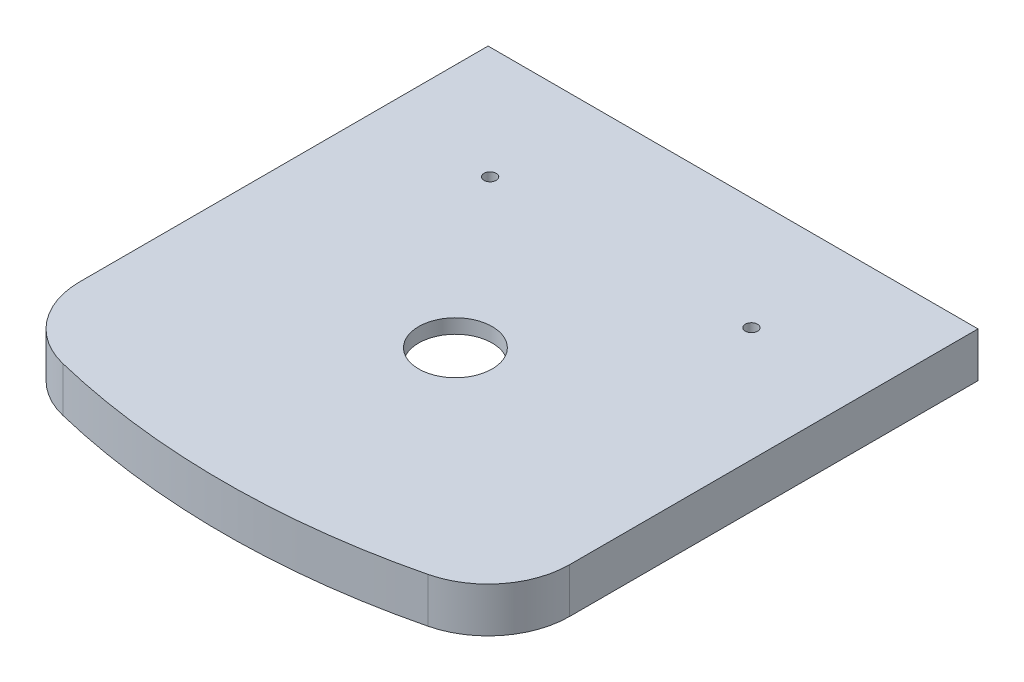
ISO-10303-21;
HEADER;
FILE_DESCRIPTION(('STEP AP214'),'2;1');
FILE_NAME('part.step','',(''),(''),'','','');
FILE_SCHEMA(('AUTOMOTIVE_DESIGN { 1 0 10303 214 1 1 1 1 }'));
ENDSEC;
DATA;
#1=APPLICATION_CONTEXT('core data for automotive mechanical design processes');
#2=APPLICATION_PROTOCOL_DEFINITION('international standard','automotive_design',2000,#1);
#3=PRODUCT_CONTEXT('',#1,'mechanical');
#4=PRODUCT('Part','Part','',(#3));
#5=PRODUCT_RELATED_PRODUCT_CATEGORY('part','',(#4));
#6=PRODUCT_DEFINITION_FORMATION('','',#4);
#7=PRODUCT_DEFINITION_CONTEXT('part definition',#1,'design');
#8=PRODUCT_DEFINITION('design','',#6,#7);
#9=PRODUCT_DEFINITION_SHAPE('','',#8);
#10=(LENGTH_UNIT() NAMED_UNIT(*) SI_UNIT(.MILLI.,.METRE.));
#11=(NAMED_UNIT(*) PLANE_ANGLE_UNIT() SI_UNIT($,.RADIAN.));
#12=(NAMED_UNIT(*) SI_UNIT($,.STERADIAN.) SOLID_ANGLE_UNIT());
#13=UNCERTAINTY_MEASURE_WITH_UNIT(LENGTH_MEASURE(1.E-05),#10,'distance_accuracy_value','');
#14=(GEOMETRIC_REPRESENTATION_CONTEXT(3) GLOBAL_UNCERTAINTY_ASSIGNED_CONTEXT((#13)) GLOBAL_UNIT_ASSIGNED_CONTEXT((#10,
#11,#12)) REPRESENTATION_CONTEXT('',''));
#15=CARTESIAN_POINT('',(0.,0.,0.));
#16=DIRECTION('',(0.,0.,1.));
#17=DIRECTION('',(1.,0.,0.));
#18=AXIS2_PLACEMENT_3D('',#15,#16,#17);
#19=CARTESIAN_POINT('',(20.,7.5,-20.));
#20=DIRECTION('',(0.,-1.,0.));
#21=DIRECTION('',(0.,0.,-1.));
#22=AXIS2_PLACEMENT_3D('',#19,#20,#21);
#23=PLANE('',#22);
#24=CARTESIAN_POINT('',(32.5,7.5,-99.));
#25=DIRECTION('',(0.,-1.,0.));
#26=DIRECTION('',(0.,0.,1.));
#27=AXIS2_PLACEMENT_3D('',#24,#25,#26);
#28=CIRCLE('',#27,5.);
#29=CARTESIAN_POINT('',(32.5,7.5,-94.));
#30=VERTEX_POINT('',#29);
#31=EDGE_CURVE('E563',#30,#30,#28,.T.);
#32=ORIENTED_EDGE('',*,*,#31,.F.);
#33=EDGE_LOOP('',(#32));
#34=FACE_BOUND('',#33,.T.);
#35=CARTESIAN_POINT('',(28.,7.5,-92.5));
#36=DIRECTION('',(0.,-1.,0.));
#37=DIRECTION('',(0.,0.,1.));
#38=AXIS2_PLACEMENT_3D('',#35,#36,#37);
#39=CIRCLE('',#38,1.5);
#40=CARTESIAN_POINT('',(26.5571011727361,7.5,-92.9099304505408));
#41=VERTEX_POINT('',#40);
#42=CARTESIAN_POINT('',(28.2163960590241,7.5,-91.0156911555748));
#43=VERTEX_POINT('',#42);
#44=EDGE_CURVE('E579',#41,#43,#39,.T.);
#45=ORIENTED_EDGE('',*,*,#44,.F.);
#46=DIRECTION('',(0.658917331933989,0.,0.752215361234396));
#47=VECTOR('',#46,1.);
#48=CARTESIAN_POINT('',(5.89293172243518,7.5,-116.5));
#49=LINE('',#48,#47);
#50=CARTESIAN_POINT('',(5.89293172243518,7.5,-116.5));
#51=VERTEX_POINT('',#50);
#52=EDGE_CURVE('E42',#51,#41,#49,.T.);
#53=ORIENTED_EDGE('',*,*,#52,.F.);
#54=DIRECTION('',(-1.,0.,0.));
#55=VECTOR('',#54,1.);
#56=CARTESIAN_POINT('',(20.,7.5,-116.5));
#57=LINE('',#56,#55);
#58=CARTESIAN_POINT('',(58.1999999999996,7.5,-116.500000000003));
#59=VERTEX_POINT('',#58);
#60=EDGE_CURVE('E520',#59,#51,#57,.T.);
#61=ORIENTED_EDGE('',*,*,#60,.F.);
#62=DIRECTION('',(0.,0.,-1.));
#63=VECTOR('',#62,1.);
#64=CARTESIAN_POINT('',(58.2,7.5,-73.5000000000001));
#65=LINE('',#64,#63);
#66=CARTESIAN_POINT('',(58.2,7.5,-73.5000000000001));
#67=VERTEX_POINT('',#66);
#68=EDGE_CURVE('E765',#67,#59,#65,.T.);
#69=ORIENTED_EDGE('',*,*,#68,.F.);
#70=CARTESIAN_POINT('',(60.7681751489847,7.5,-49.9572425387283));
#71=DIRECTION('',(0.,-1.,0.));
#72=DIRECTION('',(0.,0.,-1.));
#73=AXIS2_PLACEMENT_3D('',#70,#71,#72);
#74=CIRCLE('',#73,23.6824186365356);
#75=CARTESIAN_POINT('',(47.1872650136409,7.5,-69.3586814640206));
#76=VERTEX_POINT('',#75);
#77=EDGE_CURVE('E767',#76,#67,#74,.T.);
#78=ORIENTED_EDGE('',*,*,#77,.F.);
#79=EDGE_CURVE('E347',#43,#76,#49,.T.);
#80=ORIENTED_EDGE('',*,*,#79,.F.);
#81=EDGE_LOOP('',(#45,#53,#61,#69,#78,#80));
#82=FACE_BOUND('',#81,.T.);
#83=ADVANCED_FACE('F27',(#34,#82),#23,.T.);
#84=CARTESIAN_POINT('',(87.5,7.5,-99.));
#85=DIRECTION('',(0.,-1.,0.));
#86=DIRECTION('',(0.,0.,-1.));
#87=AXIS2_PLACEMENT_3D('',#84,#85,#86);
#88=CIRCLE('',#87,5.00000000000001);
#89=CARTESIAN_POINT('',(87.5,7.5,-104.));
#90=VERTEX_POINT('',#89);
#91=EDGE_CURVE('E536',#90,#90,#88,.T.);
#92=ORIENTED_EDGE('',*,*,#91,.F.);
#93=EDGE_LOOP('',(#92));
#94=FACE_BOUND('',#93,.T.);
#95=CARTESIAN_POINT('',(114.107068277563,7.5,-116.5));
#96=VERTEX_POINT('',#95);
#97=CARTESIAN_POINT('',(61.8,7.5,-116.500000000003));
#98=VERTEX_POINT('',#97);
#99=EDGE_CURVE('E367',#96,#98,#57,.T.);
#100=ORIENTED_EDGE('',*,*,#99,.F.);
#101=DIRECTION('',(0.658917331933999,0.,-0.752215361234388));
#102=VECTOR('',#101,1.);
#103=CARTESIAN_POINT('',(114.107068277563,7.5,-116.5));
#104=LINE('',#103,#102);
#105=CARTESIAN_POINT('',(93.4428988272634,7.5,-92.9099304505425));
#106=VERTEX_POINT('',#105);
#107=EDGE_CURVE('E760',#106,#96,#104,.T.);
#108=ORIENTED_EDGE('',*,*,#107,.F.);
#109=CARTESIAN_POINT('',(92.,7.5,-92.5));
#110=DIRECTION('',(0.,-1.,0.));
#111=DIRECTION('',(0.,0.,-1.));
#112=AXIS2_PLACEMENT_3D('',#109,#110,#111);
#113=CIRCLE('',#112,1.5);
#114=CARTESIAN_POINT('',(91.7836039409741,7.5,-91.0156911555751));
#115=VERTEX_POINT('',#114);
#116=EDGE_CURVE('E575',#115,#106,#113,.T.);
#117=ORIENTED_EDGE('',*,*,#116,.F.);
#118=CARTESIAN_POINT('',(72.8127349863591,7.5,-69.3586814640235));
#119=VERTEX_POINT('',#118);
#120=EDGE_CURVE('E756',#119,#115,#104,.T.);
#121=ORIENTED_EDGE('',*,*,#120,.F.);
#122=CARTESIAN_POINT('',(60.1977821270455,7.5,-52.525948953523));
#123=DIRECTION('',(0.,-1.,0.));
#124=DIRECTION('',(0.,0.,1.));
#125=AXIS2_PLACEMENT_3D('',#122,#123,#124);
#126=CIRCLE('',#125,21.0351591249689);
#127=CARTESIAN_POINT('',(61.8,7.5,-73.500000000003));
#128=VERTEX_POINT('',#127);
#129=EDGE_CURVE('E761',#128,#119,#126,.T.);
#130=ORIENTED_EDGE('',*,*,#129,.F.);
#131=DIRECTION('',(0.,0.,1.));
#132=VECTOR('',#131,1.);
#133=CARTESIAN_POINT('',(61.8,7.5,-73.500000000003));
#134=LINE('',#133,#132);
#135=EDGE_CURVE('E763',#98,#128,#134,.T.);
#136=ORIENTED_EDGE('',*,*,#135,.F.);
#137=EDGE_LOOP('',(#100,#108,#117,#121,#130,#136));
#138=FACE_BOUND('',#137,.T.);
#139=ADVANCED_FACE('F875',(#94,#138),#23,.T.);
#140=CARTESIAN_POINT('',(87.5,7.5,-69.));
#141=DIRECTION('',(0.,-1.,0.));
#142=DIRECTION('',(0.,0.,-1.));
#143=AXIS2_PLACEMENT_3D('',#140,#141,#142);
#144=CIRCLE('',#143,5.00000000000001);
#145=CARTESIAN_POINT('',(87.5,7.5,-74.));
#146=VERTEX_POINT('',#145);
#147=EDGE_CURVE('E545',#146,#146,#144,.T.);
#148=ORIENTED_EDGE('',*,*,#147,.F.);
#149=EDGE_LOOP('',(#148));
#150=FACE_BOUND('',#149,.T.);
#151=CARTESIAN_POINT('',(58.9309242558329,7.5,-51.5152409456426));
#152=DIRECTION('',(0.,-1.,0.));
#153=DIRECTION('',(0.,0.,-1.));
#154=AXIS2_PLACEMENT_3D('',#151,#152,#153);
#155=CIRCLE('',#154,22.6844286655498);
#156=CARTESIAN_POINT('',(75.5207102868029,7.5,-66.9865790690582));
#157=VERTEX_POINT('',#156);
#158=CARTESIAN_POINT('',(81.5,7.5,-53.8000000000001));
#159=VERTEX_POINT('',#158);
#160=EDGE_CURVE('E752',#157,#159,#155,.T.);
#161=ORIENTED_EDGE('',*,*,#160,.F.);
#162=DIRECTION('',(-0.658917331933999,0.,0.752215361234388));
#163=VECTOR('',#162,1.);
#164=CARTESIAN_POINT('',(116.5,7.5,-113.768246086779));
#165=LINE('',#164,#163);
#166=CARTESIAN_POINT('',(116.5,7.5,-113.768246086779));
#167=VERTEX_POINT('',#166);
#168=EDGE_CURVE('E754',#167,#157,#165,.T.);
#169=ORIENTED_EDGE('',*,*,#168,.F.);
#170=DIRECTION('',(0.,0.,-1.));
#171=VECTOR('',#170,1.);
#172=CARTESIAN_POINT('',(116.5,7.5,-20.));
#173=LINE('',#172,#171);
#174=CARTESIAN_POINT('',(116.5,7.5,-53.8000000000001));
#175=VERTEX_POINT('',#174);
#176=EDGE_CURVE('E395',#175,#167,#173,.T.);
#177=ORIENTED_EDGE('',*,*,#176,.F.);
#178=DIRECTION('',(1.,0.,0.));
#179=VECTOR('',#178,1.);
#180=CARTESIAN_POINT('',(81.5,7.5,-53.8000000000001));
#181=LINE('',#180,#179);
#182=EDGE_CURVE('E750',#159,#175,#181,.T.);
#183=ORIENTED_EDGE('',*,*,#182,.F.);
#184=EDGE_LOOP('',(#161,#169,#177,#183));
#185=FACE_BOUND('',#184,.T.);
#186=ADVANCED_FACE('F881',(#150,#185),#23,.T.);
#187=CARTESIAN_POINT('',(59.1554839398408,7.5,-52.0550489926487));
#188=DIRECTION('',(0.,-1.,0.));
#189=DIRECTION('',(0.,0.,-1.));
#190=AXIS2_PLACEMENT_3D('',#187,#188,#189);
#191=CIRCLE('',#190,22.4213872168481);
#192=CARTESIAN_POINT('',(81.5,7.5,-50.2000000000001));
#193=VERTEX_POINT('',#192);
#194=CARTESIAN_POINT('',(78.3013093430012,7.5,-40.386459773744));
#195=VERTEX_POINT('',#194);
#196=EDGE_CURVE('E746',#193,#195,#191,.T.);
#197=ORIENTED_EDGE('',*,*,#196,.F.);
#198=DIRECTION('',(-1.,0.,0.));
#199=VECTOR('',#198,1.);
#200=CARTESIAN_POINT('',(81.5,7.5,-50.2000000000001));
#201=LINE('',#200,#199);
#202=CARTESIAN_POINT('',(116.5,7.5,-50.2000000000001));
#203=VERTEX_POINT('',#202);
#204=EDGE_CURVE('E748',#203,#193,#201,.T.);
#205=ORIENTED_EDGE('',*,*,#204,.F.);
#206=CARTESIAN_POINT('',(116.5,7.5,-20.));
#207=VERTEX_POINT('',#206);
#208=EDGE_CURVE('E522',#207,#203,#173,.T.);
#209=ORIENTED_EDGE('',*,*,#208,.F.);
#210=CARTESIAN_POINT('',(100.,7.5,-20.));
#211=DIRECTION('',(0.,-1.,0.));
#212=DIRECTION('',(0.,0.,-1.));
#213=AXIS2_PLACEMENT_3D('',#210,#211,#212);
#214=CIRCLE('',#213,16.5);
#215=CARTESIAN_POINT('',(113.816984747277,7.5,-10.9810791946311));
#216=VERTEX_POINT('',#215);
#217=EDGE_CURVE('E382',#216,#207,#214,.F.);
#218=ORIENTED_EDGE('',*,*,#217,.F.);
#219=DIRECTION('',(0.770254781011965,0.,0.637736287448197));
#220=VECTOR('',#219,1.);
#221=CARTESIAN_POINT('',(113.880330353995,7.5,-10.9286318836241));
#222=LINE('',#221,#220);
#223=EDGE_CURVE('E744',#195,#216,#222,.T.);
#224=ORIENTED_EDGE('',*,*,#223,.F.);
#225=EDGE_LOOP('',(#197,#205,#209,#218,#224));
#226=FACE_BOUND('',#225,.T.);
#227=ADVANCED_FACE('F1294',(#226),#23,.T.);
#228=CARTESIAN_POINT('',(60.1050546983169,7.5,-51.6695982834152));
#229=DIRECTION('',(0.,-1.,0.));
#230=DIRECTION('',(0.,0.,-1.));
#231=AXIS2_PLACEMENT_3D('',#228,#229,#230);
#232=CIRCLE('',#231,21.2373428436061);
#233=CARTESIAN_POINT('',(75.7153329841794,7.5,-37.2701558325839));
#234=VERTEX_POINT('',#233);
#235=CARTESIAN_POINT('',(61.8,7.5,-30.5000000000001));
#236=VERTEX_POINT('',#235);
#237=EDGE_CURVE('E740',#234,#236,#232,.T.);
#238=ORIENTED_EDGE('',*,*,#237,.F.);
#239=DIRECTION('',(-0.769557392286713,0.,-0.638577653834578));
#240=VECTOR('',#239,1.);
#241=CARTESIAN_POINT('',(111.196832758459,7.5,-7.82765666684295));
#242=LINE('',#241,#240);
#243=CARTESIAN_POINT('',(111.166628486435,7.5,-7.85272012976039));
#244=VERTEX_POINT('',#243);
#245=EDGE_CURVE('E742',#244,#234,#242,.T.);
#246=ORIENTED_EDGE('',*,*,#245,.F.);
#247=CARTESIAN_POINT('',(103.920231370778,7.5,-3.97246787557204));
#248=VERTEX_POINT('',#247);
#249=EDGE_CURVE('E384',#248,#244,#214,.F.);
#250=ORIENTED_EDGE('',*,*,#249,.F.);
#251=CARTESIAN_POINT('',(60.,7.5,-183.536593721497));
#252=DIRECTION('',(0.,-1.,0.));
#253=DIRECTION('',(0.,0.,-1.));
#254=AXIS2_PLACEMENT_3D('',#251,#252,#253);
#255=CIRCLE('',#254,184.857409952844);
#256=CARTESIAN_POINT('',(61.8,7.5,1.31205251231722));
#257=VERTEX_POINT('',#256);
#258=EDGE_CURVE('E376',#257,#248,#255,.F.);
#259=ORIENTED_EDGE('',*,*,#258,.F.);
#260=DIRECTION('',(0.,0.,1.));
#261=VECTOR('',#260,1.);
#262=CARTESIAN_POINT('',(61.8,7.5,-30.5000000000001));
#263=LINE('',#262,#261);
#264=EDGE_CURVE('E738',#236,#257,#263,.T.);
#265=ORIENTED_EDGE('',*,*,#264,.F.);
#266=EDGE_LOOP('',(#238,#246,#250,#259,#265));
#267=FACE_BOUND('',#266,.T.);
#268=ADVANCED_FACE('F1007',(#267),#23,.T.);
#269=CARTESIAN_POINT('',(58.3568231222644,7.5,1.31351307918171));
#270=VERTEX_POINT('',#269);
#271=CARTESIAN_POINT('',(61.6431768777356,7.5,1.31351307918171));
#272=VERTEX_POINT('',#271);
#273=EDGE_CURVE('E383',#270,#272,#255,.F.);
#274=ORIENTED_EDGE('',*,*,#273,.F.);
#275=CARTESIAN_POINT('',(60.,7.5,38.2854309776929));
#276=DIRECTION('',(0.,1.,0.));
#277=DIRECTION('',(0.,0.,-1.));
#278=AXIS2_PLACEMENT_3D('',#275,#276,#277);
#279=CIRCLE('',#278,37.0084144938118);
#280=EDGE_CURVE('E736',#272,#270,#279,.T.);
#281=ORIENTED_EDGE('',*,*,#280,.F.);
#282=EDGE_LOOP('',(#274,#281));
#283=FACE_BOUND('',#282,.T.);
#284=ADVANCED_FACE('F1001',(#283),#23,.T.);
#285=CARTESIAN_POINT('',(59.8010616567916,7.5,-51.5872801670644));
#286=DIRECTION('',(0.,-1.,0.));
#287=DIRECTION('',(0.,0.,-1.));
#288=AXIS2_PLACEMENT_3D('',#285,#286,#287);
#289=CIRCLE('',#288,21.1479735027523);
#290=CARTESIAN_POINT('',(58.2,7.5,-30.5000000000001));
#291=VERTEX_POINT('',#290);
#292=CARTESIAN_POINT('',(44.3022510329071,7.5,-37.1989636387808));
#293=VERTEX_POINT('',#292);
#294=EDGE_CURVE('E733',#291,#293,#289,.T.);
#295=ORIENTED_EDGE('',*,*,#294,.F.);
#296=DIRECTION('',(0.,0.,-1.));
#297=VECTOR('',#296,1.);
#298=CARTESIAN_POINT('',(58.2,7.5,-30.5000000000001));
#299=LINE('',#298,#297);
#300=CARTESIAN_POINT('',(58.2,7.5,1.31205251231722));
#301=VERTEX_POINT('',#300);
#302=EDGE_CURVE('E503',#301,#291,#299,.T.);
#303=ORIENTED_EDGE('',*,*,#302,.F.);
#304=CARTESIAN_POINT('',(16.0797686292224,7.5,-3.97246787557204));
#305=VERTEX_POINT('',#304);
#306=EDGE_CURVE('E379',#305,#301,#255,.F.);
#307=ORIENTED_EDGE('',*,*,#306,.F.);
#308=CARTESIAN_POINT('',(20.,7.5,-20.));
#309=DIRECTION('',(0.,-1.,0.));
#310=DIRECTION('',(0.,0.,-1.));
#311=AXIS2_PLACEMENT_3D('',#308,#309,#310);
#312=CIRCLE('',#311,16.5);
#313=CARTESIAN_POINT('',(8.20888162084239,7.5,-8.45792361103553));
#314=VERTEX_POINT('',#313);
#315=EDGE_CURVE('E362',#314,#305,#312,.F.);
#316=ORIENTED_EDGE('',*,*,#315,.F.);
#317=DIRECTION('',(-0.782279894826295,0.,0.622927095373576));
#318=VECTOR('',#317,1.);
#319=CARTESIAN_POINT('',(44.3022510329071,7.5,-37.1989636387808));
#320=LINE('',#319,#318);
#321=EDGE_CURVE('E501',#293,#314,#320,.T.);
#322=ORIENTED_EDGE('',*,*,#321,.F.);
#323=EDGE_LOOP('',(#295,#303,#307,#316,#322));
#324=FACE_BOUND('',#323,.T.);
#325=ADVANCED_FACE('F500',(#324),#23,.T.);
#326=CARTESIAN_POINT('',(60.7640983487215,7.5,-52.2670610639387));
#327=DIRECTION('',(0.,-1.,0.));
#328=DIRECTION('',(0.,0.,-1.));
#329=AXIS2_PLACEMENT_3D('',#326,#327,#328);
#330=CIRCLE('',#329,22.3598483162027);
#331=CARTESIAN_POINT('',(42.0597134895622,7.5,-40.0151712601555));
#332=VERTEX_POINT('',#331);
#333=CARTESIAN_POINT('',(38.5,7.5,-50.2000000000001));
#334=VERTEX_POINT('',#333);
#335=EDGE_CURVE('E728',#332,#334,#330,.T.);
#336=ORIENTED_EDGE('',*,*,#335,.F.);
#337=DIRECTION('',(0.782279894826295,0.,-0.622927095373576));
#338=VECTOR('',#337,1.);
#339=CARTESIAN_POINT('',(42.0597134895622,7.5,-40.0151712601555));
#340=LINE('',#339,#338);
#341=CARTESIAN_POINT('',(5.98624040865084,7.5,-11.2899746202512));
#342=VERTEX_POINT('',#341);
#343=EDGE_CURVE('E730',#342,#332,#340,.T.);
#344=ORIENTED_EDGE('',*,*,#343,.F.);
#345=CARTESIAN_POINT('',(3.50000000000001,7.5,-20.));
#346=VERTEX_POINT('',#345);
#347=EDGE_CURVE('E365',#346,#342,#312,.F.);
#348=ORIENTED_EDGE('',*,*,#347,.F.);
#349=DIRECTION('',(0.,0.,1.));
#350=VECTOR('',#349,1.);
#351=CARTESIAN_POINT('',(3.5,7.5,-20.));
#352=LINE('',#351,#350);
#353=CARTESIAN_POINT('',(3.5,7.5,-50.2000000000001));
#354=VERTEX_POINT('',#353);
#355=EDGE_CURVE('E363',#354,#346,#352,.T.);
#356=ORIENTED_EDGE('',*,*,#355,.F.);
#357=DIRECTION('',(-1.,0.,0.));
#358=VECTOR('',#357,1.);
#359=CARTESIAN_POINT('',(38.5,7.5,-50.2000000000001));
#360=LINE('',#359,#358);
#361=EDGE_CURVE('E726',#334,#354,#360,.T.);
#362=ORIENTED_EDGE('',*,*,#361,.F.);
#363=EDGE_LOOP('',(#336,#344,#348,#356,#362));
#364=FACE_BOUND('',#363,.T.);
#365=ADVANCED_FACE('F1317',(#364),#23,.T.);
#366=CARTESIAN_POINT('',(32.5,7.5,-69.));
#367=DIRECTION('',(0.,-1.,0.));
#368=DIRECTION('',(0.,0.,1.));
#369=AXIS2_PLACEMENT_3D('',#366,#367,#368);
#370=CIRCLE('',#369,5.);
#371=CARTESIAN_POINT('',(32.5,7.5,-64.));
#372=VERTEX_POINT('',#371);
#373=EDGE_CURVE('E554',#372,#372,#370,.T.);
#374=ORIENTED_EDGE('',*,*,#373,.F.);
#375=EDGE_LOOP('',(#374));
#376=FACE_BOUND('',#375,.T.);
#377=CARTESIAN_POINT('',(3.5,7.5,-113.768246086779));
#378=VERTEX_POINT('',#377);
#379=CARTESIAN_POINT('',(3.5,7.5,-53.8000000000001));
#380=VERTEX_POINT('',#379);
#381=EDGE_CURVE('E354',#378,#380,#352,.T.);
#382=ORIENTED_EDGE('',*,*,#381,.F.);
#383=DIRECTION('',(-0.658917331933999,0.,-0.752215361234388));
#384=VECTOR('',#383,1.);
#385=CARTESIAN_POINT('',(3.5,7.5,-113.768246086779));
#386=LINE('',#385,#384);
#387=CARTESIAN_POINT('',(44.4792897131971,7.5,-66.9865790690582));
#388=VERTEX_POINT('',#387);
#389=EDGE_CURVE('E336',#388,#378,#386,.T.);
#390=ORIENTED_EDGE('',*,*,#389,.F.);
#391=CARTESIAN_POINT('',(58.8893568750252,7.5,-52.5036072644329));
#392=DIRECTION('',(0.,-1.,0.));
#393=DIRECTION('',(0.,0.,-1.));
#394=AXIS2_PLACEMENT_3D('',#391,#392,#393);
#395=CIRCLE('',#394,20.4305288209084);
#396=CARTESIAN_POINT('',(38.5,7.5,-53.8000000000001));
#397=VERTEX_POINT('',#396);
#398=EDGE_CURVE('E723',#397,#388,#395,.T.);
#399=ORIENTED_EDGE('',*,*,#398,.F.);
#400=DIRECTION('',(1.,0.,0.));
#401=VECTOR('',#400,1.);
#402=CARTESIAN_POINT('',(38.5,7.5,-53.8000000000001));
#403=LINE('',#402,#401);
#404=EDGE_CURVE('E361',#380,#397,#403,.T.);
#405=ORIENTED_EDGE('',*,*,#404,.F.);
#406=EDGE_LOOP('',(#382,#390,#399,#405));
#407=FACE_BOUND('',#406,.T.);
#408=ADVANCED_FACE('F360',(#376,#407),#23,.T.);
#409=CARTESIAN_POINT('',(116.5,11.,-20.));
#410=DIRECTION('',(-1.,0.,0.));
#411=DIRECTION('',(0.,0.,1.));
#412=AXIS2_PLACEMENT_3D('',#409,#410,#411);
#413=PLANE('',#412);
#414=DIRECTION('',(0.,0.,1.));
#415=VECTOR('',#414,1.);
#416=CARTESIAN_POINT('',(116.5,0.5,-113.768246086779));
#417=LINE('',#416,#415);
#418=CARTESIAN_POINT('',(116.5,0.5,-116.5));
#419=VERTEX_POINT('',#418);
#420=CARTESIAN_POINT('',(116.5,0.5,-113.768246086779));
#421=VERTEX_POINT('',#420);
#422=EDGE_CURVE('E700',#419,#421,#417,.T.);
#423=ORIENTED_EDGE('',*,*,#422,.F.);
#424=DIRECTION('',(0.,-1.,0.));
#425=VECTOR('',#424,1.);
#426=CARTESIAN_POINT('',(116.5,11.,-116.5));
#427=LINE('',#426,#425);
#428=CARTESIAN_POINT('',(116.5,0.,-116.5));
#429=VERTEX_POINT('',#428);
#430=EDGE_CURVE('E411',#419,#429,#427,.T.);
#431=ORIENTED_EDGE('',*,*,#430,.T.);
#432=DIRECTION('',(0.,0.,-1.));
#433=VECTOR('',#432,1.);
#434=CARTESIAN_POINT('',(116.5,0.,-20.));
#435=LINE('',#434,#433);
#436=CARTESIAN_POINT('',(116.5,0.,-20.));
#437=VERTEX_POINT('',#436);
#438=EDGE_CURVE('E387',#437,#429,#435,.T.);
#439=ORIENTED_EDGE('',*,*,#438,.F.);
#440=DIRECTION('',(0.,1.,0.));
#441=VECTOR('',#440,1.);
#442=CARTESIAN_POINT('',(116.5,11.,-20.));
#443=LINE('',#442,#441);
#444=EDGE_CURVE('E378',#207,#437,#443,.F.);
#445=ORIENTED_EDGE('',*,*,#444,.F.);
#446=ORIENTED_EDGE('',*,*,#208,.T.);
#447=DIRECTION('',(0.,1.,0.));
#448=VECTOR('',#447,1.);
#449=CARTESIAN_POINT('',(116.5,0.5,-50.2000000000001));
#450=LINE('',#449,#448);
#451=CARTESIAN_POINT('',(116.5,0.5,-50.2000000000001));
#452=VERTEX_POINT('',#451);
#453=EDGE_CURVE('E623',#452,#203,#450,.T.);
#454=ORIENTED_EDGE('',*,*,#453,.F.);
#455=DIRECTION('',(0.,0.,1.));
#456=VECTOR('',#455,1.);
#457=CARTESIAN_POINT('',(116.5,0.5,-50.2000000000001));
#458=LINE('',#457,#456);
#459=CARTESIAN_POINT('',(116.5,0.5,-53.8000000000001));
#460=VERTEX_POINT('',#459);
#461=EDGE_CURVE('E692',#460,#452,#458,.T.);
#462=ORIENTED_EDGE('',*,*,#461,.F.);
#463=DIRECTION('',(0.,1.,0.));
#464=VECTOR('',#463,1.);
#465=CARTESIAN_POINT('',(116.5,0.5,-53.8000000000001));
#466=LINE('',#465,#464);
#467=EDGE_CURVE('E620',#460,#175,#466,.T.);
#468=ORIENTED_EDGE('',*,*,#467,.T.);
#469=ORIENTED_EDGE('',*,*,#176,.T.);
#470=DIRECTION('',(0.,1.,0.));
#471=VECTOR('',#470,1.);
#472=CARTESIAN_POINT('',(116.5,0.5,-113.768246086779));
#473=LINE('',#472,#471);
#474=EDGE_CURVE('E612',#421,#167,#473,.T.);
#475=ORIENTED_EDGE('',*,*,#474,.F.);
#476=EDGE_LOOP('',(#423,#431,#439,#445,#446,#454,#462,#468,#469,#475));
#477=FACE_BOUND('',#476,.T.);
#478=ADVANCED_FACE('F963',(#477),#413,.T.);
#479=CARTESIAN_POINT('',(0.,11.,-116.5));
#480=DIRECTION('',(0.,0.,1.));
#481=DIRECTION('',(1.,0.,0.));
#482=AXIS2_PLACEMENT_3D('',#479,#480,#481);
#483=PLANE('',#482);
#484=DIRECTION('',(1.,0.,0.));
#485=VECTOR('',#484,1.);
#486=CARTESIAN_POINT('',(3.5,0.5,-116.5));
#487=LINE('',#486,#485);
#488=CARTESIAN_POINT('',(3.5,0.5,-116.5));
#489=VERTEX_POINT('',#488);
#490=CARTESIAN_POINT('',(5.89293172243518,0.5,-116.5));
#491=VERTEX_POINT('',#490);
#492=EDGE_CURVE('E718',#489,#491,#487,.T.);
#493=ORIENTED_EDGE('',*,*,#492,.F.);
#494=DIRECTION('',(0.,-1.,0.));
#495=VECTOR('',#494,1.);
#496=CARTESIAN_POINT('',(3.5,11.,-116.5));
#497=LINE('',#496,#495);
#498=CARTESIAN_POINT('',(3.5,0.,-116.5));
#499=VERTEX_POINT('',#498);
#500=EDGE_CURVE('E50',#489,#499,#497,.T.);
#501=ORIENTED_EDGE('',*,*,#500,.T.);
#502=DIRECTION('',(-1.,0.,0.));
#503=VECTOR('',#502,1.);
#504=CARTESIAN_POINT('',(20.,0.,-116.5));
#505=LINE('',#504,#503);
#506=EDGE_CURVE('E390',#429,#499,#505,.T.);
#507=ORIENTED_EDGE('',*,*,#506,.F.);
#508=ORIENTED_EDGE('',*,*,#430,.F.);
#509=DIRECTION('',(1.,0.,0.));
#510=VECTOR('',#509,1.);
#511=CARTESIAN_POINT('',(116.5,0.5,-116.5));
#512=LINE('',#511,#510);
#513=CARTESIAN_POINT('',(114.107068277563,0.5,-116.5));
#514=VERTEX_POINT('',#513);
#515=EDGE_CURVE('E702',#514,#419,#512,.T.);
#516=ORIENTED_EDGE('',*,*,#515,.F.);
#517=DIRECTION('',(0.,1.,0.));
#518=VECTOR('',#517,1.);
#519=CARTESIAN_POINT('',(114.107068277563,0.5,-116.5));
#520=LINE('',#519,#518);
#521=EDGE_CURVE('E609',#514,#96,#520,.T.);
#522=ORIENTED_EDGE('',*,*,#521,.T.);
#523=ORIENTED_EDGE('',*,*,#99,.T.);
#524=DIRECTION('',(0.,1.,0.));
#525=VECTOR('',#524,1.);
#526=CARTESIAN_POINT('',(61.8,0.5,-116.500000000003));
#527=LINE('',#526,#525);
#528=CARTESIAN_POINT('',(61.8,0.5,-116.500000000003));
#529=VERTEX_POINT('',#528);
#530=EDGE_CURVE('E601',#529,#98,#527,.T.);
#531=ORIENTED_EDGE('',*,*,#530,.F.);
#532=DIRECTION('',(1.,0.,0.));
#533=VECTOR('',#532,1.);
#534=CARTESIAN_POINT('',(61.8,0.5,-116.500000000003));
#535=LINE('',#534,#533);
#536=CARTESIAN_POINT('',(58.1999999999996,0.5,-116.500000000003));
#537=VERTEX_POINT('',#536);
#538=EDGE_CURVE('E710',#537,#529,#535,.T.);
#539=ORIENTED_EDGE('',*,*,#538,.F.);
#540=DIRECTION('',(0.,1.,0.));
#541=VECTOR('',#540,1.);
#542=CARTESIAN_POINT('',(58.1999999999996,0.5,-116.500000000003));
#543=LINE('',#542,#541);
#544=EDGE_CURVE('E599',#537,#59,#543,.T.);
#545=ORIENTED_EDGE('',*,*,#544,.T.);
#546=ORIENTED_EDGE('',*,*,#60,.T.);
#547=DIRECTION('',(0.,1.,0.));
#548=VECTOR('',#547,1.);
#549=CARTESIAN_POINT('',(5.89293172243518,0.5,-116.5));
#550=LINE('',#549,#548);
#551=EDGE_CURVE('E357',#491,#51,#550,.T.);
#552=ORIENTED_EDGE('',*,*,#551,.F.);
#553=EDGE_LOOP('',(#493,#501,#507,#508,#516,#522,#523,#531,#539,#545,#546,#552));
#554=FACE_BOUND('',#553,.T.);
#555=ADVANCED_FACE('F966',(#554),#483,.T.);
#556=CARTESIAN_POINT('',(3.5,11.,-20.));
#557=DIRECTION('',(1.,0.,0.));
#558=DIRECTION('',(0.,0.,-1.));
#559=AXIS2_PLACEMENT_3D('',#556,#557,#558);
#560=PLANE('',#559);
#561=DIRECTION('',(0.,0.,-1.));
#562=VECTOR('',#561,1.);
#563=CARTESIAN_POINT('',(3.5,0.5,-113.768246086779));
#564=LINE('',#563,#562);
#565=CARTESIAN_POINT('',(3.5,0.5,-113.768246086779));
#566=VERTEX_POINT('',#565);
#567=EDGE_CURVE('E355',#566,#489,#564,.T.);
#568=ORIENTED_EDGE('',*,*,#567,.F.);
#569=DIRECTION('',(0.,1.,0.));
#570=VECTOR('',#569,1.);
#571=CARTESIAN_POINT('',(3.5,0.5,-113.768246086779));
#572=LINE('',#571,#570);
#573=EDGE_CURVE('E340',#566,#378,#572,.T.);
#574=ORIENTED_EDGE('',*,*,#573,.T.);
#575=ORIENTED_EDGE('',*,*,#381,.T.);
#576=DIRECTION('',(0.,1.,0.));
#577=VECTOR('',#576,1.);
#578=CARTESIAN_POINT('',(3.5,0.5,-53.8000000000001));
#579=LINE('',#578,#577);
#580=CARTESIAN_POINT('',(3.5,0.5,-53.8000000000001));
#581=VERTEX_POINT('',#580);
#582=EDGE_CURVE('E651',#581,#380,#579,.T.);
#583=ORIENTED_EDGE('',*,*,#582,.F.);
#584=DIRECTION('',(0.,0.,-1.));
#585=VECTOR('',#584,1.);
#586=CARTESIAN_POINT('',(3.5,0.5,-50.2000000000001));
#587=LINE('',#586,#585);
#588=CARTESIAN_POINT('',(3.5,0.5,-50.2000000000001));
#589=VERTEX_POINT('',#588);
#590=EDGE_CURVE('E661',#589,#581,#587,.T.);
#591=ORIENTED_EDGE('',*,*,#590,.F.);
#592=DIRECTION('',(0.,1.,0.));
#593=VECTOR('',#592,1.);
#594=CARTESIAN_POINT('',(3.5,0.5,-50.2000000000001));
#595=LINE('',#594,#593);
#596=EDGE_CURVE('E649',#589,#354,#595,.T.);
#597=ORIENTED_EDGE('',*,*,#596,.T.);
#598=ORIENTED_EDGE('',*,*,#355,.T.);
#599=DIRECTION('',(0.,-1.,0.));
#600=VECTOR('',#599,1.);
#601=CARTESIAN_POINT('',(3.50000000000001,11.,-20.));
#602=LINE('',#601,#600);
#603=CARTESIAN_POINT('',(3.5,0.,-20.));
#604=VERTEX_POINT('',#603);
#605=EDGE_CURVE('E370',#346,#604,#602,.T.);
#606=ORIENTED_EDGE('',*,*,#605,.T.);
#607=DIRECTION('',(0.,0.,1.));
#608=VECTOR('',#607,1.);
#609=CARTESIAN_POINT('',(3.5,0.,-20.));
#610=LINE('',#609,#608);
#611=EDGE_CURVE('E402',#499,#604,#610,.T.);
#612=ORIENTED_EDGE('',*,*,#611,.F.);
#613=ORIENTED_EDGE('',*,*,#500,.F.);
#614=EDGE_LOOP('',(#568,#574,#575,#583,#591,#597,#598,#606,#612,#613));
#615=FACE_BOUND('',#614,.T.);
#616=ADVANCED_FACE('F352',(#615),#560,.T.);
#617=CARTESIAN_POINT('',(20.,11.,-20.));
#618=DIRECTION('',(0.,-1.,0.));
#619=DIRECTION('',(0.,0.,-1.));
#620=AXIS2_PLACEMENT_3D('',#617,#618,#619);
#621=CYLINDRICAL_SURFACE('',#620,16.5);
#622=CARTESIAN_POINT('',(20.,0.5,-20.));
#623=DIRECTION('',(0.,-1.,0.));
#624=DIRECTION('',(0.,0.,-1.));
#625=AXIS2_PLACEMENT_3D('',#622,#623,#624);
#626=CIRCLE('',#625,16.5);
#627=CARTESIAN_POINT('',(8.20888162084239,0.5,-8.45792361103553));
#628=VERTEX_POINT('',#627);
#629=CARTESIAN_POINT('',(5.98624040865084,0.5,-11.2899746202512));
#630=VERTEX_POINT('',#629);
#631=EDGE_CURVE('E492',#628,#630,#626,.T.);
#632=ORIENTED_EDGE('',*,*,#631,.F.);
#633=DIRECTION('',(0.,-1.,0.));
#634=VECTOR('',#633,1.);
#635=CARTESIAN_POINT('',(8.20888162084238,11.,-8.45792361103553));
#636=LINE('',#635,#634);
#637=EDGE_CURVE('E35',#628,#314,#636,.F.);
#638=ORIENTED_EDGE('',*,*,#637,.T.);
#639=ORIENTED_EDGE('',*,*,#315,.T.);
#640=DIRECTION('',(0.,-1.,0.));
#641=VECTOR('',#640,1.);
#642=CARTESIAN_POINT('',(16.0797686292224,11.,-3.97246787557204));
#643=LINE('',#642,#641);
#644=CARTESIAN_POINT('',(16.0797686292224,0.,-3.97246787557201));
#645=VERTEX_POINT('',#644);
#646=EDGE_CURVE('E372',#305,#645,#643,.T.);
#647=ORIENTED_EDGE('',*,*,#646,.T.);
#648=CARTESIAN_POINT('',(20.,0.,-20.));
#649=DIRECTION('',(0.,-1.,0.));
#650=DIRECTION('',(0.,0.,-1.));
#651=AXIS2_PLACEMENT_3D('',#648,#649,#650);
#652=CIRCLE('',#651,16.5);
#653=EDGE_CURVE('E399',#604,#645,#652,.F.);
#654=ORIENTED_EDGE('',*,*,#653,.F.);
#655=ORIENTED_EDGE('',*,*,#605,.F.);
#656=ORIENTED_EDGE('',*,*,#347,.T.);
#657=DIRECTION('',(0.,-1.,0.));
#658=VECTOR('',#657,1.);
#659=CARTESIAN_POINT('',(5.98624040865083,11.,-11.2899746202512));
#660=LINE('',#659,#658);
#661=EDGE_CURVE('E484',#342,#630,#660,.T.);
#662=ORIENTED_EDGE('',*,*,#661,.T.);
#663=EDGE_LOOP('',(#632,#638,#639,#647,#654,#655,#656,#662));
#664=FACE_BOUND('',#663,.T.);
#665=ADVANCED_FACE('F490',(#664),#621,.F.);
#666=CARTESIAN_POINT('',(60.,11.,-183.536593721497));
#667=DIRECTION('',(0.,-1.,0.));
#668=DIRECTION('',(0.,0.,-1.));
#669=AXIS2_PLACEMENT_3D('',#666,#667,#668);
#670=CYLINDRICAL_SURFACE('',#669,184.857409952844);
#671=CARTESIAN_POINT('',(60.,0.5,-183.536593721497));
#672=DIRECTION('',(0.,-1.,0.));
#673=DIRECTION('',(0.,0.,-1.));
#674=AXIS2_PLACEMENT_3D('',#671,#672,#673);
#675=CIRCLE('',#674,184.857409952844);
#676=CARTESIAN_POINT('',(61.8,0.5,1.31205251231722));
#677=VERTEX_POINT('',#676);
#678=CARTESIAN_POINT('',(61.6431768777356,0.5,1.31351307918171));
#679=VERTEX_POINT('',#678);
#680=EDGE_CURVE('E590',#677,#679,#675,.T.);
#681=ORIENTED_EDGE('',*,*,#680,.F.);
#682=DIRECTION('',(0.,-1.,0.));
#683=VECTOR('',#682,1.);
#684=CARTESIAN_POINT('',(61.8,11.,1.31205251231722));
#685=LINE('',#684,#683);
#686=EDGE_CURVE('E481',#677,#257,#685,.F.);
#687=ORIENTED_EDGE('',*,*,#686,.T.);
#688=ORIENTED_EDGE('',*,*,#258,.T.);
#689=DIRECTION('',(0.,-1.,0.));
#690=VECTOR('',#689,1.);
#691=CARTESIAN_POINT('',(103.920231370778,11.,-3.97246787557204));
#692=LINE('',#691,#690);
#693=CARTESIAN_POINT('',(103.920231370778,0.,-3.97246787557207));
#694=VERTEX_POINT('',#693);
#695=EDGE_CURVE('E373',#248,#694,#692,.T.);
#696=ORIENTED_EDGE('',*,*,#695,.T.);
#697=CARTESIAN_POINT('',(60.,0.,-183.536593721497));
#698=DIRECTION('',(0.,-1.,0.));
#699=DIRECTION('',(0.,0.,-1.));
#700=AXIS2_PLACEMENT_3D('',#697,#698,#699);
#701=CIRCLE('',#700,184.857409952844);
#702=EDGE_CURVE('E396',#645,#694,#701,.F.);
#703=ORIENTED_EDGE('',*,*,#702,.F.);
#704=ORIENTED_EDGE('',*,*,#646,.F.);
#705=ORIENTED_EDGE('',*,*,#306,.T.);
#706=DIRECTION('',(0.,-1.,0.));
#707=VECTOR('',#706,1.);
#708=CARTESIAN_POINT('',(58.2,11.,1.31205251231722));
#709=LINE('',#708,#707);
#710=CARTESIAN_POINT('',(58.2,0.5,1.31205251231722));
#711=VERTEX_POINT('',#710);
#712=EDGE_CURVE('E472',#301,#711,#709,.T.);
#713=ORIENTED_EDGE('',*,*,#712,.T.);
#714=CARTESIAN_POINT('',(58.3568231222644,0.5,1.31351307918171));
#715=VERTEX_POINT('',#714);
#716=EDGE_CURVE('E356',#715,#711,#675,.T.);
#717=ORIENTED_EDGE('',*,*,#716,.F.);
#718=DIRECTION('',(0.,1.,0.));
#719=VECTOR('',#718,1.);
#720=CARTESIAN_POINT('',(58.3568231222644,4.,1.31351307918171));
#721=LINE('',#720,#719);
#722=EDGE_CURVE('E475',#715,#270,#721,.T.);
#723=ORIENTED_EDGE('',*,*,#722,.T.);
#724=ORIENTED_EDGE('',*,*,#273,.T.);
#725=DIRECTION('',(0.,1.,0.));
#726=VECTOR('',#725,1.);
#727=CARTESIAN_POINT('',(61.6431768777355,4.,1.31351307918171));
#728=LINE('',#727,#726);
#729=EDGE_CURVE('E478',#272,#679,#728,.F.);
#730=ORIENTED_EDGE('',*,*,#729,.T.);
#731=EDGE_LOOP('',(#681,#687,#688,#696,#703,#704,#705,#713,#717,#723,#724,#730));
#732=FACE_BOUND('',#731,.T.);
#733=ADVANCED_FACE('F506',(#732),#670,.F.);
#734=CARTESIAN_POINT('',(100.,11.,-20.));
#735=DIRECTION('',(0.,-1.,0.));
#736=DIRECTION('',(0.,0.,-1.));
#737=AXIS2_PLACEMENT_3D('',#734,#735,#736);
#738=CYLINDRICAL_SURFACE('',#737,16.5);
#739=CARTESIAN_POINT('',(100.,0.5,-20.));
#740=DIRECTION('',(0.,-1.,0.));
#741=DIRECTION('',(0.,0.,-1.));
#742=AXIS2_PLACEMENT_3D('',#739,#740,#741);
#743=CIRCLE('',#742,16.5);
#744=CARTESIAN_POINT('',(113.816984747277,0.5,-10.9810791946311));
#745=VERTEX_POINT('',#744);
#746=CARTESIAN_POINT('',(111.166628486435,0.5,-7.85272012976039));
#747=VERTEX_POINT('',#746);
#748=EDGE_CURVE('E467',#745,#747,#743,.T.);
#749=ORIENTED_EDGE('',*,*,#748,.F.);
#750=DIRECTION('',(0.,-1.,0.));
#751=VECTOR('',#750,1.);
#752=CARTESIAN_POINT('',(113.816984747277,11.,-10.9810791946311));
#753=LINE('',#752,#751);
#754=EDGE_CURVE('E469',#745,#216,#753,.F.);
#755=ORIENTED_EDGE('',*,*,#754,.T.);
#756=ORIENTED_EDGE('',*,*,#217,.T.);
#757=ORIENTED_EDGE('',*,*,#444,.T.);
#758=CARTESIAN_POINT('',(100.,0.,-20.));
#759=DIRECTION('',(0.,-1.,0.));
#760=DIRECTION('',(0.,0.,-1.));
#761=AXIS2_PLACEMENT_3D('',#758,#759,#760);
#762=CIRCLE('',#761,16.5);
#763=EDGE_CURVE('E392',#694,#437,#762,.F.);
#764=ORIENTED_EDGE('',*,*,#763,.F.);
#765=ORIENTED_EDGE('',*,*,#695,.F.);
#766=ORIENTED_EDGE('',*,*,#249,.T.);
#767=DIRECTION('',(0.,-1.,0.));
#768=VECTOR('',#767,1.);
#769=CARTESIAN_POINT('',(111.166628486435,11.,-7.85272012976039));
#770=LINE('',#769,#768);
#771=EDGE_CURVE('E464',#244,#747,#770,.T.);
#772=ORIENTED_EDGE('',*,*,#771,.T.);
#773=EDGE_LOOP('',(#749,#755,#756,#757,#764,#765,#766,#772));
#774=FACE_BOUND('',#773,.T.);
#775=ADVANCED_FACE('F817',(#774),#738,.F.);
#776=CARTESIAN_POINT('',(60.,7.5,-52.0000000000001));
#777=DIRECTION('',(0.,-1.,0.));
#778=DIRECTION('',(0.,0.,-1.));
#779=AXIS2_PLACEMENT_3D('',#776,#777,#778);
#780=CIRCLE('',#779,19.);
#781=CARTESIAN_POINT('',(60.,7.5,-71.0000000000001));
#782=VERTEX_POINT('',#781);
#783=EDGE_CURVE('E11',#782,#782,#780,.F.);
#784=ORIENTED_EDGE('',*,*,#783,.F.);
#785=EDGE_LOOP('',(#784));
#786=FACE_BOUND('',#785,.T.);
#787=CARTESIAN_POINT('',(60.,7.5,-52.0000000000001));
#788=DIRECTION('',(0.,-1.,0.));
#789=DIRECTION('',(0.,0.,-1.));
#790=AXIS2_PLACEMENT_3D('',#787,#788,#789);
#791=CIRCLE('',#790,9.);
#792=CARTESIAN_POINT('',(60.,7.5,-43.0000000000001));
#793=VERTEX_POINT('',#792);
#794=EDGE_CURVE('E583',#793,#793,#791,.T.);
#795=ORIENTED_EDGE('',*,*,#794,.F.);
#796=EDGE_LOOP('',(#795));
#797=FACE_BOUND('',#796,.T.);
#798=ADVANCED_FACE('F814',(#786,#797),#23,.T.);
#799=CARTESIAN_POINT('',(20.,0.,-20.));
#800=DIRECTION('',(0.,-1.,0.));
#801=DIRECTION('',(0.,0.,-1.));
#802=AXIS2_PLACEMENT_3D('',#799,#800,#801);
#803=PLANE('',#802);
#804=DIRECTION('',(0.,0.,-1.));
#805=VECTOR('',#804,1.);
#806=CARTESIAN_POINT('',(120.,0.,-20.));
#807=LINE('',#806,#805);
#808=CARTESIAN_POINT('',(120.,0.,-20.));
#809=VERTEX_POINT('',#808);
#810=CARTESIAN_POINT('',(120.,0.,-120.));
#811=VERTEX_POINT('',#810);
#812=EDGE_CURVE('E407',#809,#811,#807,.T.);
#813=ORIENTED_EDGE('',*,*,#812,.F.);
#814=CARTESIAN_POINT('',(100.,0.,-20.));
#815=DIRECTION('',(0.,1.,0.));
#816=DIRECTION('',(0.,0.,1.));
#817=AXIS2_PLACEMENT_3D('',#814,#815,#816);
#818=CIRCLE('',#817,20.);
#819=CARTESIAN_POINT('',(104.751795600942,0.,-0.572688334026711));
#820=VERTEX_POINT('',#819);
#821=EDGE_CURVE('E419',#820,#809,#818,.T.);
#822=ORIENTED_EDGE('',*,*,#821,.F.);
#823=CARTESIAN_POINT('',(60.,0.,-183.536593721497));
#824=DIRECTION('',(0.,1.,0.));
#825=DIRECTION('',(0.,0.,1.));
#826=AXIS2_PLACEMENT_3D('',#823,#824,#825);
#827=CIRCLE('',#826,188.357409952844);
#828=CARTESIAN_POINT('',(15.2482043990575,0.,-0.572688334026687));
#829=VERTEX_POINT('',#828);
#830=EDGE_CURVE('E417',#829,#820,#827,.T.);
#831=ORIENTED_EDGE('',*,*,#830,.F.);
#832=CARTESIAN_POINT('',(20.,0.,-20.));
#833=DIRECTION('',(0.,1.,0.));
#834=DIRECTION('',(0.,0.,-1.));
#835=AXIS2_PLACEMENT_3D('',#832,#833,#834);
#836=CIRCLE('',#835,20.);
#837=CARTESIAN_POINT('',(0.,0.,-20.));
#838=VERTEX_POINT('',#837);
#839=EDGE_CURVE('E415',#838,#829,#836,.T.);
#840=ORIENTED_EDGE('',*,*,#839,.F.);
#841=DIRECTION('',(0.,0.,1.));
#842=VECTOR('',#841,1.);
#843=CARTESIAN_POINT('',(0.,0.,-20.));
#844=LINE('',#843,#842);
#845=CARTESIAN_POINT('',(0.,0.,-120.));
#846=VERTEX_POINT('',#845);
#847=EDGE_CURVE('E413',#846,#838,#844,.T.);
#848=ORIENTED_EDGE('',*,*,#847,.F.);
#849=DIRECTION('',(-1.,0.,0.));
#850=VECTOR('',#849,1.);
#851=CARTESIAN_POINT('',(0.,0.,-120.));
#852=LINE('',#851,#850);
#853=EDGE_CURVE('E410',#811,#846,#852,.T.);
#854=ORIENTED_EDGE('',*,*,#853,.F.);
#855=EDGE_LOOP('',(#813,#822,#831,#840,#848,#854));
#856=FACE_BOUND('',#855,.T.);
#857=ORIENTED_EDGE('',*,*,#763,.T.);
#858=ORIENTED_EDGE('',*,*,#438,.T.);
#859=ORIENTED_EDGE('',*,*,#506,.T.);
#860=ORIENTED_EDGE('',*,*,#611,.T.);
#861=ORIENTED_EDGE('',*,*,#653,.T.);
#862=ORIENTED_EDGE('',*,*,#702,.T.);
#863=EDGE_LOOP('',(#857,#858,#859,#860,#861,#862));
#864=FACE_BOUND('',#863,.T.);
#865=ADVANCED_FACE('F513',(#856,#864),#803,.T.);
#866=CARTESIAN_POINT('',(120.,11.,-20.));
#867=DIRECTION('',(-1.,0.,0.));
#868=DIRECTION('',(0.,0.,1.));
#869=AXIS2_PLACEMENT_3D('',#866,#867,#868);
#870=PLANE('',#869);
#871=ORIENTED_EDGE('',*,*,#812,.T.);
#872=DIRECTION('',(0.,-1.,0.));
#873=VECTOR('',#872,1.);
#874=CARTESIAN_POINT('',(120.,11.,-120.));
#875=LINE('',#874,#873);
#876=CARTESIAN_POINT('',(120.,11.,-120.));
#877=VERTEX_POINT('',#876);
#878=EDGE_CURVE('E449',#877,#811,#875,.T.);
#879=ORIENTED_EDGE('',*,*,#878,.F.);
#880=DIRECTION('',(0.,0.,-1.));
#881=VECTOR('',#880,1.);
#882=CARTESIAN_POINT('',(120.,11.,-20.));
#883=LINE('',#882,#881);
#884=CARTESIAN_POINT('',(120.,11.,-20.));
#885=VERTEX_POINT('',#884);
#886=EDGE_CURVE('E421',#885,#877,#883,.T.);
#887=ORIENTED_EDGE('',*,*,#886,.F.);
#888=DIRECTION('',(0.,-1.,0.));
#889=VECTOR('',#888,1.);
#890=CARTESIAN_POINT('',(120.,11.,-20.));
#891=LINE('',#890,#889);
#892=EDGE_CURVE('E434',#885,#809,#891,.T.);
#893=ORIENTED_EDGE('',*,*,#892,.T.);
#894=EDGE_LOOP('',(#871,#879,#887,#893));
#895=FACE_BOUND('',#894,.T.);
#896=ADVANCED_FACE('F29',(#895),#870,.F.);
#897=CARTESIAN_POINT('',(0.,11.,-120.));
#898=DIRECTION('',(0.,0.,1.));
#899=DIRECTION('',(1.,0.,0.));
#900=AXIS2_PLACEMENT_3D('',#897,#898,#899);
#901=PLANE('',#900);
#902=ORIENTED_EDGE('',*,*,#853,.T.);
#903=DIRECTION('',(0.,-1.,0.));
#904=VECTOR('',#903,1.);
#905=CARTESIAN_POINT('',(0.,11.,-120.));
#906=LINE('',#905,#904);
#907=CARTESIAN_POINT('',(0.,11.,-120.));
#908=VERTEX_POINT('',#907);
#909=EDGE_CURVE('E446',#908,#846,#906,.T.);
#910=ORIENTED_EDGE('',*,*,#909,.F.);
#911=DIRECTION('',(-1.,0.,0.));
#912=VECTOR('',#911,1.);
#913=CARTESIAN_POINT('',(0.,11.,-120.));
#914=LINE('',#913,#912);
#915=EDGE_CURVE('E424',#877,#908,#914,.T.);
#916=ORIENTED_EDGE('',*,*,#915,.F.);
#917=ORIENTED_EDGE('',*,*,#878,.T.);
#918=EDGE_LOOP('',(#902,#910,#916,#917));
#919=FACE_BOUND('',#918,.T.);
#920=ADVANCED_FACE('F848',(#919),#901,.F.);
#921=CARTESIAN_POINT('',(0.,11.,-20.));
#922=DIRECTION('',(1.,0.,0.));
#923=DIRECTION('',(0.,0.,-1.));
#924=AXIS2_PLACEMENT_3D('',#921,#922,#923);
#925=PLANE('',#924);
#926=ORIENTED_EDGE('',*,*,#847,.T.);
#927=DIRECTION('',(0.,-1.,0.));
#928=VECTOR('',#927,1.);
#929=CARTESIAN_POINT('',(0.,11.,-20.));
#930=LINE('',#929,#928);
#931=CARTESIAN_POINT('',(0.,11.,-20.));
#932=VERTEX_POINT('',#931);
#933=EDGE_CURVE('E443',#932,#838,#930,.T.);
#934=ORIENTED_EDGE('',*,*,#933,.F.);
#935=DIRECTION('',(0.,0.,1.));
#936=VECTOR('',#935,1.);
#937=CARTESIAN_POINT('',(0.,11.,-20.));
#938=LINE('',#937,#936);
#939=EDGE_CURVE('E426',#908,#932,#938,.T.);
#940=ORIENTED_EDGE('',*,*,#939,.F.);
#941=ORIENTED_EDGE('',*,*,#909,.T.);
#942=EDGE_LOOP('',(#926,#934,#940,#941));
#943=FACE_BOUND('',#942,.T.);
#944=ADVANCED_FACE('F853',(#943),#925,.F.);
#945=CARTESIAN_POINT('',(20.,11.,-20.));
#946=DIRECTION('',(0.,-1.,0.));
#947=DIRECTION('',(0.,0.,-1.));
#948=AXIS2_PLACEMENT_3D('',#945,#946,#947);
#949=CYLINDRICAL_SURFACE('',#948,20.);
#950=ORIENTED_EDGE('',*,*,#839,.T.);
#951=DIRECTION('',(0.,-1.,0.));
#952=VECTOR('',#951,1.);
#953=CARTESIAN_POINT('',(15.2482043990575,11.,-0.572688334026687));
#954=LINE('',#953,#952);
#955=CARTESIAN_POINT('',(15.2482043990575,11.,-0.572688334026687));
#956=VERTEX_POINT('',#955);
#957=EDGE_CURVE('E440',#956,#829,#954,.T.);
#958=ORIENTED_EDGE('',*,*,#957,.F.);
#959=CARTESIAN_POINT('',(20.,11.,-20.));
#960=DIRECTION('',(0.,1.,0.));
#961=DIRECTION('',(0.,0.,-1.));
#962=AXIS2_PLACEMENT_3D('',#959,#960,#961);
#963=CIRCLE('',#962,20.);
#964=EDGE_CURVE('E428',#932,#956,#963,.T.);
#965=ORIENTED_EDGE('',*,*,#964,.F.);
#966=ORIENTED_EDGE('',*,*,#933,.T.);
#967=EDGE_LOOP('',(#950,#958,#965,#966));
#968=FACE_BOUND('',#967,.T.);
#969=ADVANCED_FACE('F859',(#968),#949,.T.);
#970=CARTESIAN_POINT('',(60.,11.,-183.536593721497));
#971=DIRECTION('',(0.,-1.,0.));
#972=DIRECTION('',(0.,0.,-1.));
#973=AXIS2_PLACEMENT_3D('',#970,#971,#972);
#974=CYLINDRICAL_SURFACE('',#973,188.357409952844);
#975=ORIENTED_EDGE('',*,*,#830,.T.);
#976=DIRECTION('',(0.,-1.,0.));
#977=VECTOR('',#976,1.);
#978=CARTESIAN_POINT('',(104.751795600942,11.,-0.572688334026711));
#979=LINE('',#978,#977);
#980=CARTESIAN_POINT('',(104.751795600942,11.,-0.572688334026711));
#981=VERTEX_POINT('',#980);
#982=EDGE_CURVE('E437',#981,#820,#979,.T.);
#983=ORIENTED_EDGE('',*,*,#982,.F.);
#984=CARTESIAN_POINT('',(60.,11.,-183.536593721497));
#985=DIRECTION('',(0.,1.,0.));
#986=DIRECTION('',(0.,0.,1.));
#987=AXIS2_PLACEMENT_3D('',#984,#985,#986);
#988=CIRCLE('',#987,188.357409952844);
#989=EDGE_CURVE('E430',#956,#981,#988,.T.);
#990=ORIENTED_EDGE('',*,*,#989,.F.);
#991=ORIENTED_EDGE('',*,*,#957,.T.);
#992=EDGE_LOOP('',(#975,#983,#990,#991));
#993=FACE_BOUND('',#992,.T.);
#994=ADVANCED_FACE('F863',(#993),#974,.T.);
#995=CARTESIAN_POINT('',(100.,11.,-20.));
#996=DIRECTION('',(0.,-1.,0.));
#997=DIRECTION('',(0.,0.,-1.));
#998=AXIS2_PLACEMENT_3D('',#995,#996,#997);
#999=CYLINDRICAL_SURFACE('',#998,20.);
#1000=ORIENTED_EDGE('',*,*,#821,.T.);
#1001=ORIENTED_EDGE('',*,*,#892,.F.);
#1002=CARTESIAN_POINT('',(100.,11.,-20.));
#1003=DIRECTION('',(0.,1.,0.));
#1004=DIRECTION('',(0.,0.,1.));
#1005=AXIS2_PLACEMENT_3D('',#1002,#1003,#1004);
#1006=CIRCLE('',#1005,20.);
#1007=EDGE_CURVE('E432',#981,#885,#1006,.T.);
#1008=ORIENTED_EDGE('',*,*,#1007,.F.);
#1009=ORIENTED_EDGE('',*,*,#982,.T.);
#1010=EDGE_LOOP('',(#1000,#1001,#1008,#1009));
#1011=FACE_BOUND('',#1010,.T.);
#1012=ADVANCED_FACE('F834',(#1011),#999,.T.);
#1013=CARTESIAN_POINT('',(20.,11.,-20.));
#1014=DIRECTION('',(0.,-1.,0.));
#1015=DIRECTION('',(0.,0.,-1.));
#1016=AXIS2_PLACEMENT_3D('',#1013,#1014,#1015);
#1017=PLANE('',#1016);
#1018=CARTESIAN_POINT('',(60.,11.,-52.0000000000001));
#1019=DIRECTION('',(0.,1.,0.));
#1020=DIRECTION('',(0.,0.,1.));
#1021=AXIS2_PLACEMENT_3D('',#1018,#1019,#1020);
#1022=CIRCLE('',#1021,9.);
#1023=CARTESIAN_POINT('',(60.,11.,-43.0000000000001));
#1024=VERTEX_POINT('',#1023);
#1025=EDGE_CURVE('E586',#1024,#1024,#1022,.T.);
#1026=ORIENTED_EDGE('',*,*,#1025,.F.);
#1027=EDGE_LOOP('',(#1026));
#1028=FACE_BOUND('',#1027,.T.);
#1029=CARTESIAN_POINT('',(28.,11.,-92.5));
#1030=DIRECTION('',(0.,-1.,0.));
#1031=DIRECTION('',(0.,0.,1.));
#1032=AXIS2_PLACEMENT_3D('',#1029,#1030,#1031);
#1033=CIRCLE('',#1032,1.5);
#1034=CARTESIAN_POINT('',(28.,11.,-91.));
#1035=VERTEX_POINT('',#1034);
#1036=EDGE_CURVE('E576',#1035,#1035,#1033,.T.);
#1037=ORIENTED_EDGE('',*,*,#1036,.T.);
#1038=EDGE_LOOP('',(#1037));
#1039=FACE_BOUND('',#1038,.T.);
#1040=CARTESIAN_POINT('',(92.,11.,-92.5));
#1041=DIRECTION('',(0.,-1.,0.));
#1042=DIRECTION('',(0.,0.,-1.));
#1043=AXIS2_PLACEMENT_3D('',#1040,#1041,#1042);
#1044=CIRCLE('',#1043,1.5);
#1045=CARTESIAN_POINT('',(92.,11.,-94.));
#1046=VERTEX_POINT('',#1045);
#1047=EDGE_CURVE('E569',#1046,#1046,#1044,.T.);
#1048=ORIENTED_EDGE('',*,*,#1047,.T.);
#1049=EDGE_LOOP('',(#1048));
#1050=FACE_BOUND('',#1049,.T.);
#1051=ORIENTED_EDGE('',*,*,#886,.T.);
#1052=ORIENTED_EDGE('',*,*,#915,.T.);
#1053=ORIENTED_EDGE('',*,*,#939,.T.);
#1054=ORIENTED_EDGE('',*,*,#964,.T.);
#1055=ORIENTED_EDGE('',*,*,#989,.T.);
#1056=ORIENTED_EDGE('',*,*,#1007,.T.);
#1057=EDGE_LOOP('',(#1051,#1052,#1053,#1054,#1055,#1056));
#1058=FACE_BOUND('',#1057,.T.);
#1059=ADVANCED_FACE('F830',(#1028,#1039,#1050,#1058),#1017,.F.);
#1060=CARTESIAN_POINT('',(87.5,-2.,-99.));
#1061=DIRECTION('',(0.,-1.,0.));
#1062=DIRECTION('',(0.,0.,-1.));
#1063=AXIS2_PLACEMENT_3D('',#1060,#1061,#1062);
#1064=PLANE('',#1063);
#1065=CARTESIAN_POINT('',(87.5,-2.,-99.));
#1066=DIRECTION('',(0.,-1.,0.));
#1067=DIRECTION('',(0.,0.,-1.));
#1068=AXIS2_PLACEMENT_3D('',#1065,#1066,#1067);
#1069=CIRCLE('',#1068,5.00000000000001);
#1070=CARTESIAN_POINT('',(87.5,-2.,-104.));
#1071=VERTEX_POINT('',#1070);
#1072=EDGE_CURVE('E391',#1071,#1071,#1069,.T.);
#1073=ORIENTED_EDGE('',*,*,#1072,.T.);
#1074=EDGE_LOOP('',(#1073));
#1075=FACE_BOUND('',#1074,.T.);
#1076=CARTESIAN_POINT('',(87.5,-2.,-99.));
#1077=DIRECTION('',(0.,-1.,0.));
#1078=DIRECTION('',(0.,0.,-1.));
#1079=AXIS2_PLACEMENT_3D('',#1076,#1077,#1078);
#1080=CIRCLE('',#1079,1.5);
#1081=CARTESIAN_POINT('',(87.5,-2.,-100.5));
#1082=VERTEX_POINT('',#1081);
#1083=EDGE_CURVE('E539',#1082,#1082,#1080,.T.);
#1084=ORIENTED_EDGE('',*,*,#1083,.F.);
#1085=EDGE_LOOP('',(#1084));
#1086=FACE_BOUND('',#1085,.T.);
#1087=ADVANCED_FACE('F833',(#1075,#1086),#1064,.T.);
#1088=CARTESIAN_POINT('',(87.5,-2.,-99.));
#1089=DIRECTION('',(0.,1.,0.));
#1090=DIRECTION('',(0.,0.,1.));
#1091=AXIS2_PLACEMENT_3D('',#1088,#1089,#1090);
#1092=CYLINDRICAL_SURFACE('',#1091,5.00000000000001);
#1093=ORIENTED_EDGE('',*,*,#1072,.F.);
#1094=EDGE_LOOP('',(#1093));
#1095=FACE_BOUND('',#1094,.T.);
#1096=ORIENTED_EDGE('',*,*,#91,.T.);
#1097=EDGE_LOOP('',(#1096));
#1098=FACE_BOUND('',#1097,.T.);
#1099=ADVANCED_FACE('F898',(#1095,#1098),#1092,.T.);
#1100=CARTESIAN_POINT('',(87.5,-2.,-99.));
#1101=DIRECTION('',(0.,1.,0.));
#1102=DIRECTION('',(0.,0.,1.));
#1103=AXIS2_PLACEMENT_3D('',#1100,#1101,#1102);
#1104=CYLINDRICAL_SURFACE('',#1103,1.5);
#1105=ORIENTED_EDGE('',*,*,#1083,.T.);
#1106=EDGE_LOOP('',(#1105));
#1107=FACE_BOUND('',#1106,.T.);
#1108=CARTESIAN_POINT('',(87.5,7.5,-99.));
#1109=DIRECTION('',(0.,-1.,0.));
#1110=DIRECTION('',(0.,0.,-1.));
#1111=AXIS2_PLACEMENT_3D('',#1108,#1109,#1110);
#1112=CIRCLE('',#1111,1.5);
#1113=CARTESIAN_POINT('',(87.5,7.5,-100.5));
#1114=VERTEX_POINT('',#1113);
#1115=EDGE_CURVE('E452',#1114,#1114,#1112,.F.);
#1116=ORIENTED_EDGE('',*,*,#1115,.T.);
#1117=EDGE_LOOP('',(#1116));
#1118=FACE_BOUND('',#1117,.T.);
#1119=ADVANCED_FACE('F888',(#1107,#1118),#1104,.F.);
#1120=ORIENTED_EDGE('',*,*,#1115,.F.);
#1121=EDGE_LOOP('',(#1120));
#1122=FACE_BOUND('',#1121,.T.);
#1123=ADVANCED_FACE('F877',(#1122),#23,.T.);
#1124=CARTESIAN_POINT('',(87.5,-2.,-69.));
#1125=DIRECTION('',(0.,-1.,0.));
#1126=DIRECTION('',(0.,0.,-1.));
#1127=AXIS2_PLACEMENT_3D('',#1124,#1125,#1126);
#1128=PLANE('',#1127);
#1129=CARTESIAN_POINT('',(87.5,-2.,-69.));
#1130=DIRECTION('',(0.,-1.,0.));
#1131=DIRECTION('',(0.,0.,-1.));
#1132=AXIS2_PLACEMENT_3D('',#1129,#1130,#1131);
#1133=CIRCLE('',#1132,5.00000000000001);
#1134=CARTESIAN_POINT('',(87.5,-2.,-74.));
#1135=VERTEX_POINT('',#1134);
#1136=EDGE_CURVE('E542',#1135,#1135,#1133,.T.);
#1137=ORIENTED_EDGE('',*,*,#1136,.T.);
#1138=EDGE_LOOP('',(#1137));
#1139=FACE_BOUND('',#1138,.T.);
#1140=CARTESIAN_POINT('',(87.5,-2.,-69.));
#1141=DIRECTION('',(0.,-1.,0.));
#1142=DIRECTION('',(0.,0.,-1.));
#1143=AXIS2_PLACEMENT_3D('',#1140,#1141,#1142);
#1144=CIRCLE('',#1143,1.5);
#1145=CARTESIAN_POINT('',(87.5,-2.,-70.5));
#1146=VERTEX_POINT('',#1145);
#1147=EDGE_CURVE('E548',#1146,#1146,#1144,.T.);
#1148=ORIENTED_EDGE('',*,*,#1147,.F.);
#1149=EDGE_LOOP('',(#1148));
#1150=FACE_BOUND('',#1149,.T.);
#1151=ADVANCED_FACE('F887',(#1139,#1150),#1128,.T.);
#1152=CARTESIAN_POINT('',(87.5,-2.,-69.));
#1153=DIRECTION('',(0.,1.,0.));
#1154=DIRECTION('',(0.,0.,1.));
#1155=AXIS2_PLACEMENT_3D('',#1152,#1153,#1154);
#1156=CYLINDRICAL_SURFACE('',#1155,5.00000000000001);
#1157=ORIENTED_EDGE('',*,*,#1136,.F.);
#1158=EDGE_LOOP('',(#1157));
#1159=FACE_BOUND('',#1158,.T.);
#1160=ORIENTED_EDGE('',*,*,#147,.T.);
#1161=EDGE_LOOP('',(#1160));
#1162=FACE_BOUND('',#1161,.T.);
#1163=ADVANCED_FACE('F895',(#1159,#1162),#1156,.T.);
#1164=CARTESIAN_POINT('',(87.5,-2.,-69.));
#1165=DIRECTION('',(0.,1.,0.));
#1166=DIRECTION('',(0.,0.,1.));
#1167=AXIS2_PLACEMENT_3D('',#1164,#1165,#1166);
#1168=CYLINDRICAL_SURFACE('',#1167,1.5);
#1169=ORIENTED_EDGE('',*,*,#1147,.T.);
#1170=EDGE_LOOP('',(#1169));
#1171=FACE_BOUND('',#1170,.T.);
#1172=CARTESIAN_POINT('',(87.5,7.5,-69.));
#1173=DIRECTION('',(0.,-1.,0.));
#1174=DIRECTION('',(0.,0.,-1.));
#1175=AXIS2_PLACEMENT_3D('',#1172,#1173,#1174);
#1176=CIRCLE('',#1175,1.5);
#1177=CARTESIAN_POINT('',(87.5,7.5,-70.5));
#1178=VERTEX_POINT('',#1177);
#1179=EDGE_CURVE('E455',#1178,#1178,#1176,.F.);
#1180=ORIENTED_EDGE('',*,*,#1179,.T.);
#1181=EDGE_LOOP('',(#1180));
#1182=FACE_BOUND('',#1181,.T.);
#1183=ADVANCED_FACE('F904',(#1171,#1182),#1168,.F.);
#1184=ORIENTED_EDGE('',*,*,#1179,.F.);
#1185=EDGE_LOOP('',(#1184));
#1186=FACE_BOUND('',#1185,.T.);
#1187=ADVANCED_FACE('F890',(#1186),#23,.T.);
#1188=CARTESIAN_POINT('',(32.5,-2.,-69.));
#1189=DIRECTION('',(0.,1.,0.));
#1190=DIRECTION('',(0.,0.,1.));
#1191=AXIS2_PLACEMENT_3D('',#1188,#1189,#1190);
#1192=PLANE('',#1191);
#1193=CARTESIAN_POINT('',(32.5,-2.,-69.));
#1194=DIRECTION('',(0.,-1.,0.));
#1195=DIRECTION('',(0.,0.,1.));
#1196=AXIS2_PLACEMENT_3D('',#1193,#1194,#1195);
#1197=CIRCLE('',#1196,5.);
#1198=CARTESIAN_POINT('',(32.5,-2.,-64.));
#1199=VERTEX_POINT('',#1198);
#1200=EDGE_CURVE('E551',#1199,#1199,#1197,.T.);
#1201=ORIENTED_EDGE('',*,*,#1200,.T.);
#1202=EDGE_LOOP('',(#1201));
#1203=FACE_BOUND('',#1202,.T.);
#1204=CARTESIAN_POINT('',(32.5,-2.,-69.));
#1205=DIRECTION('',(0.,-1.,0.));
#1206=DIRECTION('',(0.,0.,1.));
#1207=AXIS2_PLACEMENT_3D('',#1204,#1205,#1206);
#1208=CIRCLE('',#1207,1.5);
#1209=CARTESIAN_POINT('',(32.5,-2.,-67.5));
#1210=VERTEX_POINT('',#1209);
#1211=EDGE_CURVE('E557',#1210,#1210,#1208,.T.);
#1212=ORIENTED_EDGE('',*,*,#1211,.F.);
#1213=EDGE_LOOP('',(#1212));
#1214=FACE_BOUND('',#1213,.T.);
#1215=ADVANCED_FACE('F903',(#1203,#1214),#1192,.F.);
#1216=CARTESIAN_POINT('',(32.5,-2.,-69.));
#1217=DIRECTION('',(0.,1.,0.));
#1218=DIRECTION('',(0.,0.,1.));
#1219=AXIS2_PLACEMENT_3D('',#1216,#1217,#1218);
#1220=CYLINDRICAL_SURFACE('',#1219,5.);
#1221=ORIENTED_EDGE('',*,*,#1200,.F.);
#1222=EDGE_LOOP('',(#1221));
#1223=FACE_BOUND('',#1222,.T.);
#1224=ORIENTED_EDGE('',*,*,#373,.T.);
#1225=EDGE_LOOP('',(#1224));
#1226=FACE_BOUND('',#1225,.T.);
#1227=ADVANCED_FACE('F911',(#1223,#1226),#1220,.T.);
#1228=CARTESIAN_POINT('',(32.5,-2.,-69.));
#1229=DIRECTION('',(0.,1.,0.));
#1230=DIRECTION('',(0.,0.,1.));
#1231=AXIS2_PLACEMENT_3D('',#1228,#1229,#1230);
#1232=CYLINDRICAL_SURFACE('',#1231,1.5);
#1233=ORIENTED_EDGE('',*,*,#1211,.T.);
#1234=EDGE_LOOP('',(#1233));
#1235=FACE_BOUND('',#1234,.T.);
#1236=CARTESIAN_POINT('',(32.5,7.5,-69.));
#1237=DIRECTION('',(0.,-1.,0.));
#1238=DIRECTION('',(0.,0.,-1.));
#1239=AXIS2_PLACEMENT_3D('',#1236,#1237,#1238);
#1240=CIRCLE('',#1239,1.5);
#1241=CARTESIAN_POINT('',(32.5,7.5,-70.5));
#1242=VERTEX_POINT('',#1241);
#1243=EDGE_CURVE('E458',#1242,#1242,#1240,.F.);
#1244=ORIENTED_EDGE('',*,*,#1243,.T.);
#1245=EDGE_LOOP('',(#1244));
#1246=FACE_BOUND('',#1245,.T.);
#1247=ADVANCED_FACE('F919',(#1235,#1246),#1232,.F.);
#1248=ORIENTED_EDGE('',*,*,#1243,.F.);
#1249=EDGE_LOOP('',(#1248));
#1250=FACE_BOUND('',#1249,.T.);
#1251=ADVANCED_FACE('F906',(#1250),#23,.T.);
#1252=CARTESIAN_POINT('',(32.5,-2.,-99.));
#1253=DIRECTION('',(0.,1.,0.));
#1254=DIRECTION('',(0.,0.,1.));
#1255=AXIS2_PLACEMENT_3D('',#1252,#1253,#1254);
#1256=PLANE('',#1255);
#1257=CARTESIAN_POINT('',(32.5,-2.,-99.));
#1258=DIRECTION('',(0.,-1.,0.));
#1259=DIRECTION('',(0.,0.,1.));
#1260=AXIS2_PLACEMENT_3D('',#1257,#1258,#1259);
#1261=CIRCLE('',#1260,5.);
#1262=CARTESIAN_POINT('',(32.5,-2.,-94.));
#1263=VERTEX_POINT('',#1262);
#1264=EDGE_CURVE('E560',#1263,#1263,#1261,.T.);
#1265=ORIENTED_EDGE('',*,*,#1264,.T.);
#1266=EDGE_LOOP('',(#1265));
#1267=FACE_BOUND('',#1266,.T.);
#1268=CARTESIAN_POINT('',(32.5,-2.,-99.));
#1269=DIRECTION('',(0.,-1.,0.));
#1270=DIRECTION('',(0.,0.,1.));
#1271=AXIS2_PLACEMENT_3D('',#1268,#1269,#1270);
#1272=CIRCLE('',#1271,1.5);
#1273=CARTESIAN_POINT('',(32.5,-2.,-97.5));
#1274=VERTEX_POINT('',#1273);
#1275=EDGE_CURVE('E566',#1274,#1274,#1272,.T.);
#1276=ORIENTED_EDGE('',*,*,#1275,.F.);
#1277=EDGE_LOOP('',(#1276));
#1278=FACE_BOUND('',#1277,.T.);
#1279=ADVANCED_FACE('F918',(#1267,#1278),#1256,.F.);
#1280=CARTESIAN_POINT('',(32.5,-2.,-99.));
#1281=DIRECTION('',(0.,1.,0.));
#1282=DIRECTION('',(0.,0.,1.));
#1283=AXIS2_PLACEMENT_3D('',#1280,#1281,#1282);
#1284=CYLINDRICAL_SURFACE('',#1283,5.);
#1285=ORIENTED_EDGE('',*,*,#1264,.F.);
#1286=EDGE_LOOP('',(#1285));
#1287=FACE_BOUND('',#1286,.T.);
#1288=ORIENTED_EDGE('',*,*,#31,.T.);
#1289=EDGE_LOOP('',(#1288));
#1290=FACE_BOUND('',#1289,.T.);
#1291=ADVANCED_FACE('F925',(#1287,#1290),#1284,.T.);
#1292=CARTESIAN_POINT('',(32.5,-2.,-99.));
#1293=DIRECTION('',(0.,1.,0.));
#1294=DIRECTION('',(0.,0.,1.));
#1295=AXIS2_PLACEMENT_3D('',#1292,#1293,#1294);
#1296=CYLINDRICAL_SURFACE('',#1295,1.5);
#1297=ORIENTED_EDGE('',*,*,#1275,.T.);
#1298=EDGE_LOOP('',(#1297));
#1299=FACE_BOUND('',#1298,.T.);
#1300=CARTESIAN_POINT('',(32.5,7.5,-99.));
#1301=DIRECTION('',(0.,-1.,0.));
#1302=DIRECTION('',(0.,0.,-1.));
#1303=AXIS2_PLACEMENT_3D('',#1300,#1301,#1302);
#1304=CIRCLE('',#1303,1.5);
#1305=CARTESIAN_POINT('',(32.5,7.5,-100.5));
#1306=VERTEX_POINT('',#1305);
#1307=EDGE_CURVE('E461',#1306,#1306,#1304,.F.);
#1308=ORIENTED_EDGE('',*,*,#1307,.T.);
#1309=EDGE_LOOP('',(#1308));
#1310=FACE_BOUND('',#1309,.T.);
#1311=ADVANCED_FACE('F933',(#1299,#1310),#1296,.F.);
#1312=ORIENTED_EDGE('',*,*,#1307,.F.);
#1313=EDGE_LOOP('',(#1312));
#1314=FACE_BOUND('',#1313,.T.);
#1315=ADVANCED_FACE('F819',(#1314),#23,.T.);
#1316=CARTESIAN_POINT('',(92.,11.,-92.5));
#1317=DIRECTION('',(0.,-1.,0.));
#1318=DIRECTION('',(0.,0.,-1.));
#1319=AXIS2_PLACEMENT_3D('',#1316,#1317,#1318);
#1320=CYLINDRICAL_SURFACE('',#1319,1.5);
#1321=ORIENTED_EDGE('',*,*,#1047,.F.);
#1322=EDGE_LOOP('',(#1321));
#1323=FACE_BOUND('',#1322,.T.);
#1324=EDGE_CURVE('E572',#106,#115,#113,.T.);
#1325=ORIENTED_EDGE('',*,*,#1324,.T.);
#1326=ORIENTED_EDGE('',*,*,#116,.T.);
#1327=EDGE_LOOP('',(#1325,#1326));
#1328=FACE_BOUND('',#1327,.T.);
#1329=ADVANCED_FACE('F932',(#1323,#1328),#1320,.F.);
#1330=CARTESIAN_POINT('',(28.,11.,-92.5));
#1331=DIRECTION('',(0.,-1.,0.));
#1332=DIRECTION('',(0.,0.,-1.));
#1333=AXIS2_PLACEMENT_3D('',#1330,#1331,#1332);
#1334=CYLINDRICAL_SURFACE('',#1333,1.5);
#1335=ORIENTED_EDGE('',*,*,#1036,.F.);
#1336=EDGE_LOOP('',(#1335));
#1337=FACE_BOUND('',#1336,.T.);
#1338=ORIENTED_EDGE('',*,*,#44,.T.);
#1339=EDGE_CURVE('E582',#43,#41,#39,.T.);
#1340=ORIENTED_EDGE('',*,*,#1339,.T.);
#1341=EDGE_LOOP('',(#1338,#1340));
#1342=FACE_BOUND('',#1341,.T.);
#1343=ADVANCED_FACE('F826',(#1337,#1342),#1334,.F.);
#1344=CARTESIAN_POINT('',(60.,-2.,-52.0000000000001));
#1345=DIRECTION('',(0.,1.,0.));
#1346=DIRECTION('',(0.,0.,1.));
#1347=AXIS2_PLACEMENT_3D('',#1344,#1345,#1346);
#1348=CYLINDRICAL_SURFACE('',#1347,9.);
#1349=CARTESIAN_POINT('',(60.,7.5,-43.0000000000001));
#1350=CARTESIAN_POINT('',(60.,7.53645833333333,-43.0000000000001));
#1351=CARTESIAN_POINT('',(60.,7.57291666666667,-43.0000000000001));
#1352=CARTESIAN_POINT('',(60.,7.64583333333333,-43.0000000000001));
#1353=CARTESIAN_POINT('',(60.,7.68229166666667,-43.0000000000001));
#1354=CARTESIAN_POINT('',(60.,7.75520833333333,-43.0000000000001));
#1355=CARTESIAN_POINT('',(60.,7.79166666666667,-43.0000000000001));
#1356=CARTESIAN_POINT('',(60.,7.86458333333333,-43.0000000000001));
#1357=CARTESIAN_POINT('',(60.,7.90104166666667,-43.0000000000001));
#1358=CARTESIAN_POINT('',(60.,7.97395833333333,-43.0000000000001));
#1359=CARTESIAN_POINT('',(60.,8.01041666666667,-43.0000000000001));
#1360=CARTESIAN_POINT('',(60.,8.08333333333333,-43.0000000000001));
#1361=CARTESIAN_POINT('',(60.,8.11979166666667,-43.0000000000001));
#1362=CARTESIAN_POINT('',(60.,8.19270833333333,-43.0000000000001));
#1363=CARTESIAN_POINT('',(60.,8.22916666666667,-43.0000000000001));
#1364=CARTESIAN_POINT('',(60.,8.30208333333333,-43.0000000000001));
#1365=CARTESIAN_POINT('',(60.,8.33854166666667,-43.0000000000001));
#1366=CARTESIAN_POINT('',(60.,8.41145833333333,-43.0000000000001));
#1367=CARTESIAN_POINT('',(60.,8.44791666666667,-43.0000000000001));
#1368=CARTESIAN_POINT('',(60.,8.52083333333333,-43.0000000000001));
#1369=CARTESIAN_POINT('',(60.,8.55729166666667,-43.0000000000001));
#1370=CARTESIAN_POINT('',(60.,8.63020833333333,-43.0000000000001));
#1371=CARTESIAN_POINT('',(60.,8.66666666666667,-43.0000000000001));
#1372=CARTESIAN_POINT('',(60.,8.73958333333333,-43.0000000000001));
#1373=CARTESIAN_POINT('',(60.,8.77604166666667,-43.0000000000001));
#1374=CARTESIAN_POINT('',(60.,8.84895833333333,-43.0000000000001));
#1375=CARTESIAN_POINT('',(60.,8.88541666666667,-43.0000000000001));
#1376=CARTESIAN_POINT('',(60.,8.95833333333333,-43.0000000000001));
#1377=CARTESIAN_POINT('',(60.,8.99479166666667,-43.0000000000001));
#1378=CARTESIAN_POINT('',(60.,9.06770833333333,-43.0000000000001));
#1379=CARTESIAN_POINT('',(60.,9.10416666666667,-43.0000000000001));
#1380=CARTESIAN_POINT('',(60.,9.17708333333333,-43.0000000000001));
#1381=CARTESIAN_POINT('',(60.,9.21354166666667,-43.0000000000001));
#1382=CARTESIAN_POINT('',(60.,9.28645833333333,-43.0000000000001));
#1383=CARTESIAN_POINT('',(60.,9.32291666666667,-43.0000000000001));
#1384=CARTESIAN_POINT('',(60.,9.39583333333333,-43.0000000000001));
#1385=CARTESIAN_POINT('',(60.,9.43229166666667,-43.0000000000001));
#1386=CARTESIAN_POINT('',(60.,9.50520833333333,-43.0000000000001));
#1387=CARTESIAN_POINT('',(60.,9.54166666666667,-43.0000000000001));
#1388=CARTESIAN_POINT('',(60.,9.61458333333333,-43.0000000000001));
#1389=CARTESIAN_POINT('',(60.,9.65104166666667,-43.0000000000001));
#1390=CARTESIAN_POINT('',(60.,9.72395833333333,-43.0000000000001));
#1391=CARTESIAN_POINT('',(60.,9.76041666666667,-43.0000000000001));
#1392=CARTESIAN_POINT('',(60.,9.83333333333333,-43.0000000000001));
#1393=CARTESIAN_POINT('',(60.,9.86979166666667,-43.0000000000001));
#1394=CARTESIAN_POINT('',(60.,9.94270833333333,-43.0000000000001));
#1395=CARTESIAN_POINT('',(60.,9.97916666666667,-43.0000000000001));
#1396=CARTESIAN_POINT('',(60.,10.0520833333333,-43.0000000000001));
#1397=CARTESIAN_POINT('',(60.,10.0885416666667,-43.0000000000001));
#1398=CARTESIAN_POINT('',(60.,10.1614583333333,-43.0000000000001));
#1399=CARTESIAN_POINT('',(60.,10.1979166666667,-43.0000000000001));
#1400=CARTESIAN_POINT('',(60.,10.2708333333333,-43.0000000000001));
#1401=CARTESIAN_POINT('',(60.,10.3072916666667,-43.0000000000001));
#1402=CARTESIAN_POINT('',(60.,10.3802083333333,-43.0000000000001));
#1403=CARTESIAN_POINT('',(60.,10.4166666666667,-43.0000000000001));
#1404=CARTESIAN_POINT('',(60.,10.4895833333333,-43.0000000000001));
#1405=CARTESIAN_POINT('',(60.,10.5260416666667,-43.0000000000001));
#1406=CARTESIAN_POINT('',(60.,10.5989583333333,-43.0000000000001));
#1407=CARTESIAN_POINT('',(60.,10.6354166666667,-43.0000000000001));
#1408=CARTESIAN_POINT('',(60.,10.7083333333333,-43.0000000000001));
#1409=CARTESIAN_POINT('',(60.,10.7447916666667,-43.0000000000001));
#1410=CARTESIAN_POINT('',(60.,10.8177083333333,-43.0000000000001));
#1411=CARTESIAN_POINT('',(60.,10.8541666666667,-43.0000000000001));
#1412=CARTESIAN_POINT('',(60.,10.9270833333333,-43.0000000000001));
#1413=CARTESIAN_POINT('',(60.,10.9635416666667,-43.0000000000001));
#1414=CARTESIAN_POINT('',(60.,11.,-43.0000000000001));
#1415=B_SPLINE_CURVE_WITH_KNOTS('',3,(#1349,#1350,#1351,#1352,#1353,#1354,#1355,#1356,#1357,
#1358,#1359,#1360,#1361,#1362,#1363,#1364,#1365,#1366,#1367,#1368,#1369,#1370,#1371,#1372,#1373,
#1374,#1375,#1376,#1377,#1378,#1379,#1380,#1381,#1382,#1383,#1384,#1385,#1386,#1387,#1388,#1389,
#1390,#1391,#1392,#1393,#1394,#1395,#1396,#1397,#1398,#1399,#1400,#1401,#1402,#1403,#1404,#1405,
#1406,#1407,#1408,#1409,#1410,#1411,#1412,#1413,#1414),.UNSPECIFIED.,.F.,.F.,(4,2,2,2,2,2,2,2,2,
2,2,2,2,2,2,2,2,2,2,2,2,2,2,2,2,2,2,2,2,2,2,2,4),(0.,0.109375,0.21875,0.328125,0.4375,0.546875,
0.656250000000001,0.765625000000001,0.875000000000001,0.984374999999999,1.09375,1.203125,1.3125,
1.421875,1.53125,1.640625,1.75,1.859375,1.96875,2.078125,2.1875,2.296875,2.40625,2.515625,2.625,
2.734375,2.84375,2.953125,3.0625,3.171875,3.28125,3.390625,3.5),.UNSPECIFIED.);
#1416=EDGE_CURVE('BSEAM822',#793,#1024,#1415,.T.);
#1417=ORIENTED_EDGE('',*,*,#794,.T.);
#1418=ORIENTED_EDGE('',*,*,#1025,.T.);
#1419=ORIENTED_EDGE('',*,*,#1416,.T.);
#1420=ORIENTED_EDGE('',*,*,#1416,.F.);
#1421=EDGE_LOOP('',(#1417,#1419,#1418,#1420));
#1422=FACE_BOUND('',#1421,.T.);
#1423=ADVANCED_FACE('F822',(#1422),#1348,.F.);
#1424=CARTESIAN_POINT('',(58.8893568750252,7.5,-52.5036072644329));
#1425=DIRECTION('',(0.,-1.,0.));
#1426=DIRECTION('',(0.,0.,-1.));
#1427=AXIS2_PLACEMENT_3D('',#1424,#1425,#1426);
#1428=PLANE('',#1427);
#1429=EDGE_CURVE('E759',#115,#106,#104,.T.);
#1430=ORIENTED_EDGE('',*,*,#1429,.F.);
#1431=ORIENTED_EDGE('',*,*,#1324,.F.);
#1432=EDGE_LOOP('',(#1430,#1431));
#1433=FACE_BOUND('',#1432,.T.);
#1434=ADVANCED_FACE('F825',(#1433),#1428,.F.);
#1435=EDGE_CURVE('E769',#41,#43,#49,.T.);
#1436=ORIENTED_EDGE('',*,*,#1435,.F.);
#1437=ORIENTED_EDGE('',*,*,#1339,.F.);
#1438=EDGE_LOOP('',(#1436,#1437));
#1439=FACE_BOUND('',#1438,.T.);
#1440=ADVANCED_FACE('F797',(#1439),#1428,.F.);
#1441=CARTESIAN_POINT('',(58.8893568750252,0.5,-52.5036072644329));
#1442=DIRECTION('',(0.,-1.,0.));
#1443=DIRECTION('',(0.,0.,-1.));
#1444=AXIS2_PLACEMENT_3D('',#1441,#1442,#1443);
#1445=PLANE('',#1444);
#1446=CARTESIAN_POINT('',(81.9038988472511,0.5,-34.5581189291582));
#1447=DIRECTION('',(0.,-1.,0.));
#1448=DIRECTION('',(0.,0.,-1.));
#1449=AXIS2_PLACEMENT_3D('',#1446,#1447,#1448);
#1450=CIRCLE('',#1449,1.5);
#1451=CARTESIAN_POINT('',(81.9038988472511,0.5,-36.0581189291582));
#1452=VERTEX_POINT('',#1451);
#1453=EDGE_CURVE('E788',#1452,#1452,#1450,.T.);
#1454=ORIENTED_EDGE('',*,*,#1453,.F.);
#1455=EDGE_LOOP('',(#1454));
#1456=FACE_BOUND('',#1455,.T.);
#1457=CARTESIAN_POINT('',(38.0961011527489,0.5,-34.5581189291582));
#1458=DIRECTION('',(0.,-1.,0.));
#1459=DIRECTION('',(0.,0.,-1.));
#1460=AXIS2_PLACEMENT_3D('',#1457,#1458,#1459);
#1461=CIRCLE('',#1460,1.5);
#1462=CARTESIAN_POINT('',(38.0961011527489,0.5,-36.0581189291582));
#1463=VERTEX_POINT('',#1462);
#1464=EDGE_CURVE('E782',#1463,#1463,#1461,.T.);
#1465=ORIENTED_EDGE('',*,*,#1464,.F.);
#1466=EDGE_LOOP('',(#1465));
#1467=FACE_BOUND('',#1466,.T.);
#1468=CARTESIAN_POINT('',(60.,0.5,-80.0000000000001));
#1469=DIRECTION('',(0.,-1.,0.));
#1470=DIRECTION('',(0.,0.,-1.));
#1471=AXIS2_PLACEMENT_3D('',#1468,#1469,#1470);
#1472=CIRCLE('',#1471,1.5);
#1473=CARTESIAN_POINT('',(60.,0.5,-81.5000000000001));
#1474=VERTEX_POINT('',#1473);
#1475=EDGE_CURVE('E776',#1474,#1474,#1472,.T.);
#1476=ORIENTED_EDGE('',*,*,#1475,.F.);
#1477=EDGE_LOOP('',(#1476));
#1478=FACE_BOUND('',#1477,.T.);
#1479=DIRECTION('',(-0.782279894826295,0.,0.622927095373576));
#1480=VECTOR('',#1479,1.);
#1481=CARTESIAN_POINT('',(44.3022510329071,0.5,-37.1989636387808));
#1482=LINE('',#1481,#1480);
#1483=CARTESIAN_POINT('',(44.3022510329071,0.5,-37.1989636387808));
#1484=VERTEX_POINT('',#1483);
#1485=EDGE_CURVE('E669',#1484,#628,#1482,.T.);
#1486=ORIENTED_EDGE('',*,*,#1485,.T.);
#1487=ORIENTED_EDGE('',*,*,#631,.T.);
#1488=DIRECTION('',(0.782279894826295,0.,-0.622927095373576));
#1489=VECTOR('',#1488,1.);
#1490=CARTESIAN_POINT('',(42.0597134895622,0.5,-40.0151712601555));
#1491=LINE('',#1490,#1489);
#1492=CARTESIAN_POINT('',(42.0597134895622,0.5,-40.0151712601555));
#1493=VERTEX_POINT('',#1492);
#1494=EDGE_CURVE('E667',#630,#1493,#1491,.T.);
#1495=ORIENTED_EDGE('',*,*,#1494,.T.);
#1496=CARTESIAN_POINT('',(60.7640983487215,0.5,-52.2670610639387));
#1497=DIRECTION('',(0.,-1.,0.));
#1498=DIRECTION('',(0.,0.,-1.));
#1499=AXIS2_PLACEMENT_3D('',#1496,#1497,#1498);
#1500=CIRCLE('',#1499,22.3598483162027);
#1501=CARTESIAN_POINT('',(38.5,0.5,-50.2000000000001));
#1502=VERTEX_POINT('',#1501);
#1503=EDGE_CURVE('E665',#1493,#1502,#1500,.T.);
#1504=ORIENTED_EDGE('',*,*,#1503,.T.);
#1505=DIRECTION('',(-1.,0.,0.));
#1506=VECTOR('',#1505,1.);
#1507=CARTESIAN_POINT('',(38.5,0.5,-50.2000000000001));
#1508=LINE('',#1507,#1506);
#1509=EDGE_CURVE('E663',#1502,#589,#1508,.T.);
#1510=ORIENTED_EDGE('',*,*,#1509,.T.);
#1511=ORIENTED_EDGE('',*,*,#590,.T.);
#1512=DIRECTION('',(1.,0.,0.));
#1513=VECTOR('',#1512,1.);
#1514=CARTESIAN_POINT('',(38.5,0.5,-53.8000000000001));
#1515=LINE('',#1514,#1513);
#1516=CARTESIAN_POINT('',(38.5,0.5,-53.8000000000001));
#1517=VERTEX_POINT('',#1516);
#1518=EDGE_CURVE('E659',#581,#1517,#1515,.T.);
#1519=ORIENTED_EDGE('',*,*,#1518,.T.);
#1520=CARTESIAN_POINT('',(58.8893568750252,0.5,-52.5036072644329));
#1521=DIRECTION('',(0.,-1.,0.));
#1522=DIRECTION('',(0.,0.,-1.));
#1523=AXIS2_PLACEMENT_3D('',#1520,#1521,#1522);
#1524=CIRCLE('',#1523,20.4305288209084);
#1525=CARTESIAN_POINT('',(44.4792897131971,0.5,-66.9865790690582));
#1526=VERTEX_POINT('',#1525);
#1527=EDGE_CURVE('E657',#1517,#1526,#1524,.T.);
#1528=ORIENTED_EDGE('',*,*,#1527,.T.);
#1529=DIRECTION('',(-0.658917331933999,0.,-0.752215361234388));
#1530=VECTOR('',#1529,1.);
#1531=CARTESIAN_POINT('',(3.5,0.5,-113.768246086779));
#1532=LINE('',#1531,#1530);
#1533=EDGE_CURVE('E721',#1526,#566,#1532,.T.);
#1534=ORIENTED_EDGE('',*,*,#1533,.T.);
#1535=ORIENTED_EDGE('',*,*,#567,.T.);
#1536=ORIENTED_EDGE('',*,*,#492,.T.);
#1537=DIRECTION('',(0.658917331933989,0.,0.752215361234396));
#1538=VECTOR('',#1537,1.);
#1539=CARTESIAN_POINT('',(5.89293172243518,0.5,-116.5));
#1540=LINE('',#1539,#1538);
#1541=CARTESIAN_POINT('',(47.1872650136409,0.5,-69.3586814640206));
#1542=VERTEX_POINT('',#1541);
#1543=EDGE_CURVE('E716',#491,#1542,#1540,.T.);
#1544=ORIENTED_EDGE('',*,*,#1543,.T.);
#1545=CARTESIAN_POINT('',(60.7681751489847,0.5,-49.9572425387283));
#1546=DIRECTION('',(0.,-1.,0.));
#1547=DIRECTION('',(0.,0.,-1.));
#1548=AXIS2_PLACEMENT_3D('',#1545,#1546,#1547);
#1549=CIRCLE('',#1548,23.6824186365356);
#1550=CARTESIAN_POINT('',(58.2,0.5,-73.5000000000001));
#1551=VERTEX_POINT('',#1550);
#1552=EDGE_CURVE('E714',#1542,#1551,#1549,.T.);
#1553=ORIENTED_EDGE('',*,*,#1552,.T.);
#1554=DIRECTION('',(0.,0.,-1.));
#1555=VECTOR('',#1554,1.);
#1556=CARTESIAN_POINT('',(58.2,0.5,-73.5000000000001));
#1557=LINE('',#1556,#1555);
#1558=EDGE_CURVE('E712',#1551,#537,#1557,.T.);
#1559=ORIENTED_EDGE('',*,*,#1558,.T.);
#1560=ORIENTED_EDGE('',*,*,#538,.T.);
#1561=DIRECTION('',(0.,0.,1.));
#1562=VECTOR('',#1561,1.);
#1563=CARTESIAN_POINT('',(61.8,0.5,-73.500000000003));
#1564=LINE('',#1563,#1562);
#1565=CARTESIAN_POINT('',(61.8,0.5,-73.500000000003));
#1566=VERTEX_POINT('',#1565);
#1567=EDGE_CURVE('E708',#529,#1566,#1564,.T.);
#1568=ORIENTED_EDGE('',*,*,#1567,.T.);
#1569=CARTESIAN_POINT('',(60.1977821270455,0.5,-52.525948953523));
#1570=DIRECTION('',(0.,-1.,0.));
#1571=DIRECTION('',(0.,0.,1.));
#1572=AXIS2_PLACEMENT_3D('',#1569,#1570,#1571);
#1573=CIRCLE('',#1572,21.0351591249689);
#1574=CARTESIAN_POINT('',(72.8127349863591,0.5,-69.3586814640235));
#1575=VERTEX_POINT('',#1574);
#1576=EDGE_CURVE('E706',#1566,#1575,#1573,.T.);
#1577=ORIENTED_EDGE('',*,*,#1576,.T.);
#1578=DIRECTION('',(0.658917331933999,0.,-0.752215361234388));
#1579=VECTOR('',#1578,1.);
#1580=CARTESIAN_POINT('',(114.107068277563,0.5,-116.5));
#1581=LINE('',#1580,#1579);
#1582=EDGE_CURVE('E704',#1575,#514,#1581,.T.);
#1583=ORIENTED_EDGE('',*,*,#1582,.T.);
#1584=ORIENTED_EDGE('',*,*,#515,.T.);
#1585=ORIENTED_EDGE('',*,*,#422,.T.);
#1586=DIRECTION('',(-0.658917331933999,0.,0.752215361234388));
#1587=VECTOR('',#1586,1.);
#1588=CARTESIAN_POINT('',(116.5,0.5,-113.768246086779));
#1589=LINE('',#1588,#1587);
#1590=CARTESIAN_POINT('',(75.5207102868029,0.5,-66.9865790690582));
#1591=VERTEX_POINT('',#1590);
#1592=EDGE_CURVE('E698',#421,#1591,#1589,.T.);
#1593=ORIENTED_EDGE('',*,*,#1592,.T.);
#1594=CARTESIAN_POINT('',(58.9309242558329,0.5,-51.5152409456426));
#1595=DIRECTION('',(0.,-1.,0.));
#1596=DIRECTION('',(0.,0.,-1.));
#1597=AXIS2_PLACEMENT_3D('',#1594,#1595,#1596);
#1598=CIRCLE('',#1597,22.6844286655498);
#1599=CARTESIAN_POINT('',(81.5,0.5,-53.8000000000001));
#1600=VERTEX_POINT('',#1599);
#1601=EDGE_CURVE('E696',#1591,#1600,#1598,.T.);
#1602=ORIENTED_EDGE('',*,*,#1601,.T.);
#1603=DIRECTION('',(1.,0.,0.));
#1604=VECTOR('',#1603,1.);
#1605=CARTESIAN_POINT('',(81.5,0.5,-53.8000000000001));
#1606=LINE('',#1605,#1604);
#1607=EDGE_CURVE('E694',#1600,#460,#1606,.T.);
#1608=ORIENTED_EDGE('',*,*,#1607,.T.);
#1609=ORIENTED_EDGE('',*,*,#461,.T.);
#1610=DIRECTION('',(-1.,0.,0.));
#1611=VECTOR('',#1610,1.);
#1612=CARTESIAN_POINT('',(81.5,0.5,-50.2000000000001));
#1613=LINE('',#1612,#1611);
#1614=CARTESIAN_POINT('',(81.5,0.5,-50.2000000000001));
#1615=VERTEX_POINT('',#1614);
#1616=EDGE_CURVE('E690',#452,#1615,#1613,.T.);
#1617=ORIENTED_EDGE('',*,*,#1616,.T.);
#1618=CARTESIAN_POINT('',(59.1554839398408,0.5,-52.0550489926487));
#1619=DIRECTION('',(0.,-1.,0.));
#1620=DIRECTION('',(0.,0.,-1.));
#1621=AXIS2_PLACEMENT_3D('',#1618,#1619,#1620);
#1622=CIRCLE('',#1621,22.4213872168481);
#1623=CARTESIAN_POINT('',(78.3013093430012,0.5,-40.386459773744));
#1624=VERTEX_POINT('',#1623);
#1625=EDGE_CURVE('E688',#1615,#1624,#1622,.T.);
#1626=ORIENTED_EDGE('',*,*,#1625,.T.);
#1627=DIRECTION('',(0.770254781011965,0.,0.637736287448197));
#1628=VECTOR('',#1627,1.);
#1629=CARTESIAN_POINT('',(113.880330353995,0.5,-10.9286318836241));
#1630=LINE('',#1629,#1628);
#1631=EDGE_CURVE('E685',#1624,#745,#1630,.T.);
#1632=ORIENTED_EDGE('',*,*,#1631,.T.);
#1633=ORIENTED_EDGE('',*,*,#748,.T.);
#1634=DIRECTION('',(-0.769557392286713,0.,-0.638577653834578));
#1635=VECTOR('',#1634,1.);
#1636=CARTESIAN_POINT('',(111.196832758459,0.5,-7.82765666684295));
#1637=LINE('',#1636,#1635);
#1638=CARTESIAN_POINT('',(75.7153329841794,0.5,-37.2701558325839));
#1639=VERTEX_POINT('',#1638);
#1640=EDGE_CURVE('E683',#747,#1639,#1637,.T.);
#1641=ORIENTED_EDGE('',*,*,#1640,.T.);
#1642=CARTESIAN_POINT('',(60.1050546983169,0.5,-51.6695982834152));
#1643=DIRECTION('',(0.,-1.,0.));
#1644=DIRECTION('',(0.,0.,-1.));
#1645=AXIS2_PLACEMENT_3D('',#1642,#1643,#1644);
#1646=CIRCLE('',#1645,21.2373428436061);
#1647=CARTESIAN_POINT('',(61.8,0.5,-30.5000000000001));
#1648=VERTEX_POINT('',#1647);
#1649=EDGE_CURVE('E681',#1639,#1648,#1646,.T.);
#1650=ORIENTED_EDGE('',*,*,#1649,.T.);
#1651=DIRECTION('',(0.,0.,1.));
#1652=VECTOR('',#1651,1.);
#1653=CARTESIAN_POINT('',(61.8,0.5,-30.5000000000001));
#1654=LINE('',#1653,#1652);
#1655=EDGE_CURVE('E678',#1648,#677,#1654,.T.);
#1656=ORIENTED_EDGE('',*,*,#1655,.T.);
#1657=ORIENTED_EDGE('',*,*,#680,.T.);
#1658=CARTESIAN_POINT('',(60.,0.5,38.2854309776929));
#1659=DIRECTION('',(0.,1.,0.));
#1660=DIRECTION('',(0.,0.,-1.));
#1661=AXIS2_PLACEMENT_3D('',#1658,#1659,#1660);
#1662=CIRCLE('',#1661,37.0084144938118);
#1663=EDGE_CURVE('E675',#679,#715,#1662,.T.);
#1664=ORIENTED_EDGE('',*,*,#1663,.T.);
#1665=ORIENTED_EDGE('',*,*,#716,.T.);
#1666=DIRECTION('',(0.,0.,-1.));
#1667=VECTOR('',#1666,1.);
#1668=CARTESIAN_POINT('',(58.2,0.5,-30.5000000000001));
#1669=LINE('',#1668,#1667);
#1670=CARTESIAN_POINT('',(58.2,0.5,-30.5000000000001));
#1671=VERTEX_POINT('',#1670);
#1672=EDGE_CURVE('E673',#711,#1671,#1669,.T.);
#1673=ORIENTED_EDGE('',*,*,#1672,.T.);
#1674=CARTESIAN_POINT('',(59.8010616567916,0.5,-51.5872801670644));
#1675=DIRECTION('',(0.,-1.,0.));
#1676=DIRECTION('',(0.,0.,-1.));
#1677=AXIS2_PLACEMENT_3D('',#1674,#1675,#1676);
#1678=CIRCLE('',#1677,21.1479735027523);
#1679=EDGE_CURVE('E671',#1671,#1484,#1678,.T.);
#1680=ORIENTED_EDGE('',*,*,#1679,.T.);
#1681=EDGE_LOOP('',(#1486,#1487,#1495,#1504,#1510,#1511,#1519,#1528,#1534,#1535,#1536,#1544,
#1553,#1559,#1560,#1568,#1577,#1583,#1584,#1585,#1593,#1602,#1608,#1609,#1617,#1626,#1632,#1633,
#1641,#1650,#1656,#1657,#1664,#1665,#1673,#1680));
#1682=FACE_BOUND('',#1681,.T.);
#1683=CARTESIAN_POINT('',(60.,0.5,-52.0000000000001));
#1684=DIRECTION('',(0.,-1.,0.));
#1685=DIRECTION('',(0.,0.,-1.));
#1686=AXIS2_PLACEMENT_3D('',#1683,#1684,#1685);
#1687=CIRCLE('',#1686,19.);
#1688=CARTESIAN_POINT('',(60.,0.5,-71.0000000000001));
#1689=VERTEX_POINT('',#1688);
#1690=EDGE_CURVE('E348',#1689,#1689,#1687,.T.);
#1691=ORIENTED_EDGE('',*,*,#1690,.F.);
#1692=EDGE_LOOP('',(#1691));
#1693=FACE_BOUND('',#1692,.T.);
#1694=ADVANCED_FACE('F794',(#1456,#1467,#1478,#1682,#1693),#1445,.T.);
#1695=CARTESIAN_POINT('',(3.5,0.5,-113.768246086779));
#1696=DIRECTION('',(0.752215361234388,0.,-0.658917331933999));
#1697=DIRECTION('',(-0.658917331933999,0.,-0.752215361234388));
#1698=AXIS2_PLACEMENT_3D('',#1695,#1696,#1697);
#1699=PLANE('',#1698);
#1700=ORIENTED_EDGE('',*,*,#389,.T.);
#1701=ORIENTED_EDGE('',*,*,#573,.F.);
#1702=ORIENTED_EDGE('',*,*,#1533,.F.);
#1703=DIRECTION('',(0.,1.,0.));
#1704=VECTOR('',#1703,1.);
#1705=CARTESIAN_POINT('',(44.4792897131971,0.5,-66.9865790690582));
#1706=LINE('',#1705,#1704);
#1707=EDGE_CURVE('E343',#1526,#388,#1706,.T.);
#1708=ORIENTED_EDGE('',*,*,#1707,.T.);
#1709=EDGE_LOOP('',(#1700,#1701,#1702,#1708));
#1710=FACE_BOUND('',#1709,.T.);
#1711=ADVANCED_FACE('F338',(#1710),#1699,.F.);
#1712=CARTESIAN_POINT('',(5.89293172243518,0.5,-116.5));
#1713=DIRECTION('',(-0.752215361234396,0.,0.658917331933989));
#1714=DIRECTION('',(0.658917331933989,0.,0.752215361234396));
#1715=AXIS2_PLACEMENT_3D('',#1712,#1713,#1714);
#1716=PLANE('',#1715);
#1717=ORIENTED_EDGE('',*,*,#52,.T.);
#1718=ORIENTED_EDGE('',*,*,#1435,.T.);
#1719=ORIENTED_EDGE('',*,*,#79,.T.);
#1720=DIRECTION('',(0.,1.,0.));
#1721=VECTOR('',#1720,1.);
#1722=CARTESIAN_POINT('',(47.1872650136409,0.5,-69.3586814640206));
#1723=LINE('',#1722,#1721);
#1724=EDGE_CURVE('E593',#1542,#76,#1723,.T.);
#1725=ORIENTED_EDGE('',*,*,#1724,.F.);
#1726=ORIENTED_EDGE('',*,*,#1543,.F.);
#1727=ORIENTED_EDGE('',*,*,#551,.T.);
#1728=EDGE_LOOP('',(#1717,#1718,#1719,#1725,#1726,#1727));
#1729=FACE_BOUND('',#1728,.T.);
#1730=ADVANCED_FACE('F1065',(#1729),#1716,.F.);
#1731=CARTESIAN_POINT('',(60.7681751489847,0.5,-49.9572425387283));
#1732=DIRECTION('',(0.,1.,0.));
#1733=DIRECTION('',(0.,0.,1.));
#1734=AXIS2_PLACEMENT_3D('',#1731,#1732,#1733);
#1735=CYLINDRICAL_SURFACE('',#1734,23.6824186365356);
#1736=ORIENTED_EDGE('',*,*,#77,.T.);
#1737=DIRECTION('',(0.,1.,0.));
#1738=VECTOR('',#1737,1.);
#1739=CARTESIAN_POINT('',(58.2,0.5,-73.5000000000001));
#1740=LINE('',#1739,#1738);
#1741=EDGE_CURVE('E596',#1551,#67,#1740,.T.);
#1742=ORIENTED_EDGE('',*,*,#1741,.F.);
#1743=ORIENTED_EDGE('',*,*,#1552,.F.);
#1744=ORIENTED_EDGE('',*,*,#1724,.T.);
#1745=EDGE_LOOP('',(#1736,#1742,#1743,#1744));
#1746=FACE_BOUND('',#1745,.T.);
#1747=ADVANCED_FACE('F1061',(#1746),#1735,.T.);
#1748=CARTESIAN_POINT('',(58.2,0.5,-73.5000000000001));
#1749=DIRECTION('',(1.,0.,0.));
#1750=DIRECTION('',(0.,0.,-1.));
#1751=AXIS2_PLACEMENT_3D('',#1748,#1749,#1750);
#1752=PLANE('',#1751);
#1753=ORIENTED_EDGE('',*,*,#68,.T.);
#1754=ORIENTED_EDGE('',*,*,#544,.F.);
#1755=ORIENTED_EDGE('',*,*,#1558,.F.);
#1756=ORIENTED_EDGE('',*,*,#1741,.T.);
#1757=EDGE_LOOP('',(#1753,#1754,#1755,#1756));
#1758=FACE_BOUND('',#1757,.T.);
#1759=ADVANCED_FACE('F1057',(#1758),#1752,.F.);
#1760=CARTESIAN_POINT('',(61.8,0.5,-73.500000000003));
#1761=DIRECTION('',(-1.,0.,0.));
#1762=DIRECTION('',(0.,0.,1.));
#1763=AXIS2_PLACEMENT_3D('',#1760,#1761,#1762);
#1764=PLANE('',#1763);
#1765=ORIENTED_EDGE('',*,*,#135,.T.);
#1766=DIRECTION('',(0.,1.,0.));
#1767=VECTOR('',#1766,1.);
#1768=CARTESIAN_POINT('',(61.8,0.5,-73.500000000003));
#1769=LINE('',#1768,#1767);
#1770=EDGE_CURVE('E603',#1566,#128,#1769,.T.);
#1771=ORIENTED_EDGE('',*,*,#1770,.F.);
#1772=ORIENTED_EDGE('',*,*,#1567,.F.);
#1773=ORIENTED_EDGE('',*,*,#530,.T.);
#1774=EDGE_LOOP('',(#1765,#1771,#1772,#1773));
#1775=FACE_BOUND('',#1774,.T.);
#1776=ADVANCED_FACE('F1053',(#1775),#1764,.F.);
#1777=CARTESIAN_POINT('',(60.1977821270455,0.5,-52.525948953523));
#1778=DIRECTION('',(0.,1.,0.));
#1779=DIRECTION('',(0.,0.,1.));
#1780=AXIS2_PLACEMENT_3D('',#1777,#1778,#1779);
#1781=CYLINDRICAL_SURFACE('',#1780,21.0351591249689);
#1782=ORIENTED_EDGE('',*,*,#129,.T.);
#1783=DIRECTION('',(0.,1.,0.));
#1784=VECTOR('',#1783,1.);
#1785=CARTESIAN_POINT('',(72.8127349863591,0.5,-69.3586814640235));
#1786=LINE('',#1785,#1784);
#1787=EDGE_CURVE('E606',#1575,#119,#1786,.T.);
#1788=ORIENTED_EDGE('',*,*,#1787,.F.);
#1789=ORIENTED_EDGE('',*,*,#1576,.F.);
#1790=ORIENTED_EDGE('',*,*,#1770,.T.);
#1791=EDGE_LOOP('',(#1782,#1788,#1789,#1790));
#1792=FACE_BOUND('',#1791,.T.);
#1793=ADVANCED_FACE('F1049',(#1792),#1781,.T.);
#1794=CARTESIAN_POINT('',(114.107068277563,0.5,-116.5));
#1795=DIRECTION('',(0.752215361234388,0.,0.658917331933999));
#1796=DIRECTION('',(0.658917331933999,0.,-0.752215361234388));
#1797=AXIS2_PLACEMENT_3D('',#1794,#1795,#1796);
#1798=PLANE('',#1797);
#1799=ORIENTED_EDGE('',*,*,#120,.T.);
#1800=ORIENTED_EDGE('',*,*,#1429,.T.);
#1801=ORIENTED_EDGE('',*,*,#107,.T.);
#1802=ORIENTED_EDGE('',*,*,#521,.F.);
#1803=ORIENTED_EDGE('',*,*,#1582,.F.);
#1804=ORIENTED_EDGE('',*,*,#1787,.T.);
#1805=EDGE_LOOP('',(#1799,#1800,#1801,#1802,#1803,#1804));
#1806=FACE_BOUND('',#1805,.T.);
#1807=ADVANCED_FACE('F1045',(#1806),#1798,.F.);
#1808=CARTESIAN_POINT('',(116.5,0.5,-113.768246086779));
#1809=DIRECTION('',(-0.752215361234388,0.,-0.658917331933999));
#1810=DIRECTION('',(-0.658917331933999,0.,0.752215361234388));
#1811=AXIS2_PLACEMENT_3D('',#1808,#1809,#1810);
#1812=PLANE('',#1811);
#1813=ORIENTED_EDGE('',*,*,#168,.T.);
#1814=DIRECTION('',(0.,1.,0.));
#1815=VECTOR('',#1814,1.);
#1816=CARTESIAN_POINT('',(75.5207102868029,0.5,-66.9865790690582));
#1817=LINE('',#1816,#1815);
#1818=EDGE_CURVE('E614',#1591,#157,#1817,.T.);
#1819=ORIENTED_EDGE('',*,*,#1818,.F.);
#1820=ORIENTED_EDGE('',*,*,#1592,.F.);
#1821=ORIENTED_EDGE('',*,*,#474,.T.);
#1822=EDGE_LOOP('',(#1813,#1819,#1820,#1821));
#1823=FACE_BOUND('',#1822,.T.);
#1824=ADVANCED_FACE('F1041',(#1823),#1812,.F.);
#1825=CARTESIAN_POINT('',(58.9309242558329,0.5,-51.5152409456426));
#1826=DIRECTION('',(0.,1.,0.));
#1827=DIRECTION('',(0.,0.,1.));
#1828=AXIS2_PLACEMENT_3D('',#1825,#1826,#1827);
#1829=CYLINDRICAL_SURFACE('',#1828,22.6844286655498);
#1830=ORIENTED_EDGE('',*,*,#160,.T.);
#1831=DIRECTION('',(0.,1.,0.));
#1832=VECTOR('',#1831,1.);
#1833=CARTESIAN_POINT('',(81.5,0.5,-53.8000000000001));
#1834=LINE('',#1833,#1832);
#1835=EDGE_CURVE('E617',#1600,#159,#1834,.T.);
#1836=ORIENTED_EDGE('',*,*,#1835,.F.);
#1837=ORIENTED_EDGE('',*,*,#1601,.F.);
#1838=ORIENTED_EDGE('',*,*,#1818,.T.);
#1839=EDGE_LOOP('',(#1830,#1836,#1837,#1838));
#1840=FACE_BOUND('',#1839,.T.);
#1841=ADVANCED_FACE('F1037',(#1840),#1829,.T.);
#1842=CARTESIAN_POINT('',(81.5,0.5,-53.8000000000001));
#1843=DIRECTION('',(0.,0.,1.));
#1844=DIRECTION('',(1.,0.,0.));
#1845=AXIS2_PLACEMENT_3D('',#1842,#1843,#1844);
#1846=PLANE('',#1845);
#1847=ORIENTED_EDGE('',*,*,#182,.T.);
#1848=ORIENTED_EDGE('',*,*,#467,.F.);
#1849=ORIENTED_EDGE('',*,*,#1607,.F.);
#1850=ORIENTED_EDGE('',*,*,#1835,.T.);
#1851=EDGE_LOOP('',(#1847,#1848,#1849,#1850));
#1852=FACE_BOUND('',#1851,.T.);
#1853=ADVANCED_FACE('F1033',(#1852),#1846,.F.);
#1854=CARTESIAN_POINT('',(81.5,0.5,-50.2000000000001));
#1855=DIRECTION('',(0.,0.,-1.));
#1856=DIRECTION('',(-1.,0.,0.));
#1857=AXIS2_PLACEMENT_3D('',#1854,#1855,#1856);
#1858=PLANE('',#1857);
#1859=ORIENTED_EDGE('',*,*,#204,.T.);
#1860=DIRECTION('',(0.,1.,0.));
#1861=VECTOR('',#1860,1.);
#1862=CARTESIAN_POINT('',(81.5,0.5,-50.2000000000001));
#1863=LINE('',#1862,#1861);
#1864=EDGE_CURVE('E625',#1615,#193,#1863,.T.);
#1865=ORIENTED_EDGE('',*,*,#1864,.F.);
#1866=ORIENTED_EDGE('',*,*,#1616,.F.);
#1867=ORIENTED_EDGE('',*,*,#453,.T.);
#1868=EDGE_LOOP('',(#1859,#1865,#1866,#1867));
#1869=FACE_BOUND('',#1868,.T.);
#1870=ADVANCED_FACE('F1029',(#1869),#1858,.F.);
#1871=CARTESIAN_POINT('',(59.1554839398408,0.5,-52.0550489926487));
#1872=DIRECTION('',(0.,1.,0.));
#1873=DIRECTION('',(0.,0.,1.));
#1874=AXIS2_PLACEMENT_3D('',#1871,#1872,#1873);
#1875=CYLINDRICAL_SURFACE('',#1874,22.4213872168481);
#1876=ORIENTED_EDGE('',*,*,#196,.T.);
#1877=DIRECTION('',(0.,1.,0.));
#1878=VECTOR('',#1877,1.);
#1879=CARTESIAN_POINT('',(78.3013093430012,0.5,-40.386459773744));
#1880=LINE('',#1879,#1878);
#1881=EDGE_CURVE('E628',#1624,#195,#1880,.T.);
#1882=ORIENTED_EDGE('',*,*,#1881,.F.);
#1883=ORIENTED_EDGE('',*,*,#1625,.F.);
#1884=ORIENTED_EDGE('',*,*,#1864,.T.);
#1885=EDGE_LOOP('',(#1876,#1882,#1883,#1884));
#1886=FACE_BOUND('',#1885,.T.);
#1887=ADVANCED_FACE('F1025',(#1886),#1875,.T.);
#1888=CARTESIAN_POINT('',(113.880330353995,0.5,-10.9286318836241));
#1889=DIRECTION('',(-0.637736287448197,0.,0.770254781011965));
#1890=DIRECTION('',(0.770254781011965,0.,0.637736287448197));
#1891=AXIS2_PLACEMENT_3D('',#1888,#1889,#1890);
#1892=PLANE('',#1891);
#1893=ORIENTED_EDGE('',*,*,#754,.F.);
#1894=ORIENTED_EDGE('',*,*,#1631,.F.);
#1895=ORIENTED_EDGE('',*,*,#1881,.T.);
#1896=ORIENTED_EDGE('',*,*,#223,.T.);
#1897=EDGE_LOOP('',(#1893,#1894,#1895,#1896));
#1898=FACE_BOUND('',#1897,.T.);
#1899=ADVANCED_FACE('F1022',(#1898),#1892,.F.);
#1900=CARTESIAN_POINT('',(111.196832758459,0.5,-7.82765666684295));
#1901=DIRECTION('',(0.638577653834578,0.,-0.769557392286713));
#1902=DIRECTION('',(-0.769557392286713,0.,-0.638577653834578));
#1903=AXIS2_PLACEMENT_3D('',#1900,#1901,#1902);
#1904=PLANE('',#1903);
#1905=ORIENTED_EDGE('',*,*,#771,.F.);
#1906=ORIENTED_EDGE('',*,*,#245,.T.);
#1907=DIRECTION('',(0.,1.,0.));
#1908=VECTOR('',#1907,1.);
#1909=CARTESIAN_POINT('',(75.7153329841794,0.5,-37.2701558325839));
#1910=LINE('',#1909,#1908);
#1911=EDGE_CURVE('E631',#1639,#234,#1910,.T.);
#1912=ORIENTED_EDGE('',*,*,#1911,.F.);
#1913=ORIENTED_EDGE('',*,*,#1640,.F.);
#1914=EDGE_LOOP('',(#1905,#1906,#1912,#1913));
#1915=FACE_BOUND('',#1914,.T.);
#1916=ADVANCED_FACE('F984',(#1915),#1904,.F.);
#1917=CARTESIAN_POINT('',(60.1050546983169,0.5,-51.6695982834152));
#1918=DIRECTION('',(0.,1.,0.));
#1919=DIRECTION('',(0.,0.,1.));
#1920=AXIS2_PLACEMENT_3D('',#1917,#1918,#1919);
#1921=CYLINDRICAL_SURFACE('',#1920,21.2373428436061);
#1922=ORIENTED_EDGE('',*,*,#237,.T.);
#1923=DIRECTION('',(0.,1.,0.));
#1924=VECTOR('',#1923,1.);
#1925=CARTESIAN_POINT('',(61.8,0.5,-30.5000000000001));
#1926=LINE('',#1925,#1924);
#1927=EDGE_CURVE('E634',#1648,#236,#1926,.T.);
#1928=ORIENTED_EDGE('',*,*,#1927,.F.);
#1929=ORIENTED_EDGE('',*,*,#1649,.F.);
#1930=ORIENTED_EDGE('',*,*,#1911,.T.);
#1931=EDGE_LOOP('',(#1922,#1928,#1929,#1930));
#1932=FACE_BOUND('',#1931,.T.);
#1933=ADVANCED_FACE('F990',(#1932),#1921,.T.);
#1934=CARTESIAN_POINT('',(61.8,0.5,-30.5000000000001));
#1935=DIRECTION('',(-1.,0.,0.));
#1936=DIRECTION('',(0.,0.,1.));
#1937=AXIS2_PLACEMENT_3D('',#1934,#1935,#1936);
#1938=PLANE('',#1937);
#1939=ORIENTED_EDGE('',*,*,#686,.F.);
#1940=ORIENTED_EDGE('',*,*,#1655,.F.);
#1941=ORIENTED_EDGE('',*,*,#1927,.T.);
#1942=ORIENTED_EDGE('',*,*,#264,.T.);
#1943=EDGE_LOOP('',(#1939,#1940,#1941,#1942));
#1944=FACE_BOUND('',#1943,.T.);
#1945=ADVANCED_FACE('F1008',(#1944),#1938,.F.);
#1946=CARTESIAN_POINT('',(60.,0.5,38.2854309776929));
#1947=DIRECTION('',(0.,1.,0.));
#1948=DIRECTION('',(0.,0.,1.));
#1949=AXIS2_PLACEMENT_3D('',#1946,#1947,#1948);
#1950=CYLINDRICAL_SURFACE('',#1949,37.0084144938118);
#1951=ORIENTED_EDGE('',*,*,#722,.F.);
#1952=ORIENTED_EDGE('',*,*,#1663,.F.);
#1953=ORIENTED_EDGE('',*,*,#729,.F.);
#1954=ORIENTED_EDGE('',*,*,#280,.T.);
#1955=EDGE_LOOP('',(#1951,#1952,#1953,#1954));
#1956=FACE_BOUND('',#1955,.T.);
#1957=ADVANCED_FACE('F999',(#1956),#1950,.F.);
#1958=CARTESIAN_POINT('',(58.2,0.5,-30.5000000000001));
#1959=DIRECTION('',(1.,0.,0.));
#1960=DIRECTION('',(0.,0.,-1.));
#1961=AXIS2_PLACEMENT_3D('',#1958,#1959,#1960);
#1962=PLANE('',#1961);
#1963=ORIENTED_EDGE('',*,*,#712,.F.);
#1964=ORIENTED_EDGE('',*,*,#302,.T.);
#1965=DIRECTION('',(0.,1.,0.));
#1966=VECTOR('',#1965,1.);
#1967=CARTESIAN_POINT('',(58.2,0.5,-30.5000000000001));
#1968=LINE('',#1967,#1966);
#1969=EDGE_CURVE('E637',#1671,#291,#1968,.T.);
#1970=ORIENTED_EDGE('',*,*,#1969,.F.);
#1971=ORIENTED_EDGE('',*,*,#1672,.F.);
#1972=EDGE_LOOP('',(#1963,#1964,#1970,#1971));
#1973=FACE_BOUND('',#1972,.T.);
#1974=ADVANCED_FACE('F1015',(#1973),#1962,.F.);
#1975=CARTESIAN_POINT('',(59.8010616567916,0.5,-51.5872801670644));
#1976=DIRECTION('',(0.,1.,0.));
#1977=DIRECTION('',(0.,0.,1.));
#1978=AXIS2_PLACEMENT_3D('',#1975,#1976,#1977);
#1979=CYLINDRICAL_SURFACE('',#1978,21.1479735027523);
#1980=ORIENTED_EDGE('',*,*,#294,.T.);
#1981=DIRECTION('',(0.,1.,0.));
#1982=VECTOR('',#1981,1.);
#1983=CARTESIAN_POINT('',(44.3022510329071,0.5,-37.1989636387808));
#1984=LINE('',#1983,#1982);
#1985=EDGE_CURVE('E640',#1484,#293,#1984,.T.);
#1986=ORIENTED_EDGE('',*,*,#1985,.F.);
#1987=ORIENTED_EDGE('',*,*,#1679,.F.);
#1988=ORIENTED_EDGE('',*,*,#1969,.T.);
#1989=EDGE_LOOP('',(#1980,#1986,#1987,#1988));
#1990=FACE_BOUND('',#1989,.T.);
#1991=ADVANCED_FACE('F1112',(#1990),#1979,.T.);
#1992=CARTESIAN_POINT('',(44.3022510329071,0.5,-37.1989636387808));
#1993=DIRECTION('',(-0.622927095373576,0.,-0.782279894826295));
#1994=DIRECTION('',(-0.782279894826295,0.,0.622927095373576));
#1995=AXIS2_PLACEMENT_3D('',#1992,#1993,#1994);
#1996=PLANE('',#1995);
#1997=ORIENTED_EDGE('',*,*,#637,.F.);
#1998=ORIENTED_EDGE('',*,*,#1485,.F.);
#1999=ORIENTED_EDGE('',*,*,#1985,.T.);
#2000=ORIENTED_EDGE('',*,*,#321,.T.);
#2001=EDGE_LOOP('',(#1997,#1998,#1999,#2000));
#2002=FACE_BOUND('',#2001,.T.);
#2003=ADVANCED_FACE('F1108',(#2002),#1996,.F.);
#2004=CARTESIAN_POINT('',(42.0597134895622,0.5,-40.0151712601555));
#2005=DIRECTION('',(0.622927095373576,0.,0.782279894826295));
#2006=DIRECTION('',(0.782279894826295,0.,-0.622927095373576));
#2007=AXIS2_PLACEMENT_3D('',#2004,#2005,#2006);
#2008=PLANE('',#2007);
#2009=ORIENTED_EDGE('',*,*,#661,.F.);
#2010=ORIENTED_EDGE('',*,*,#343,.T.);
#2011=DIRECTION('',(0.,1.,0.));
#2012=VECTOR('',#2011,1.);
#2013=CARTESIAN_POINT('',(42.0597134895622,0.5,-40.0151712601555));
#2014=LINE('',#2013,#2012);
#2015=EDGE_CURVE('E643',#1493,#332,#2014,.T.);
#2016=ORIENTED_EDGE('',*,*,#2015,.F.);
#2017=ORIENTED_EDGE('',*,*,#1494,.F.);
#2018=EDGE_LOOP('',(#2009,#2010,#2016,#2017));
#2019=FACE_BOUND('',#2018,.T.);
#2020=ADVANCED_FACE('F1104',(#2019),#2008,.F.);
#2021=CARTESIAN_POINT('',(60.7640983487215,0.5,-52.2670610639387));
#2022=DIRECTION('',(0.,1.,0.));
#2023=DIRECTION('',(0.,0.,1.));
#2024=AXIS2_PLACEMENT_3D('',#2021,#2022,#2023);
#2025=CYLINDRICAL_SURFACE('',#2024,22.3598483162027);
#2026=ORIENTED_EDGE('',*,*,#335,.T.);
#2027=DIRECTION('',(0.,1.,0.));
#2028=VECTOR('',#2027,1.);
#2029=CARTESIAN_POINT('',(38.5,0.5,-50.2000000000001));
#2030=LINE('',#2029,#2028);
#2031=EDGE_CURVE('E646',#1502,#334,#2030,.T.);
#2032=ORIENTED_EDGE('',*,*,#2031,.F.);
#2033=ORIENTED_EDGE('',*,*,#1503,.F.);
#2034=ORIENTED_EDGE('',*,*,#2015,.T.);
#2035=EDGE_LOOP('',(#2026,#2032,#2033,#2034));
#2036=FACE_BOUND('',#2035,.T.);
#2037=ADVANCED_FACE('F1100',(#2036),#2025,.T.);
#2038=CARTESIAN_POINT('',(38.5,0.5,-50.2000000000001));
#2039=DIRECTION('',(0.,0.,-1.));
#2040=DIRECTION('',(-1.,0.,0.));
#2041=AXIS2_PLACEMENT_3D('',#2038,#2039,#2040);
#2042=PLANE('',#2041);
#2043=ORIENTED_EDGE('',*,*,#361,.T.);
#2044=ORIENTED_EDGE('',*,*,#596,.F.);
#2045=ORIENTED_EDGE('',*,*,#1509,.F.);
#2046=ORIENTED_EDGE('',*,*,#2031,.T.);
#2047=EDGE_LOOP('',(#2043,#2044,#2045,#2046));
#2048=FACE_BOUND('',#2047,.T.);
#2049=ADVANCED_FACE('F1096',(#2048),#2042,.F.);
#2050=CARTESIAN_POINT('',(38.5,0.5,-53.8000000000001));
#2051=DIRECTION('',(0.,0.,1.));
#2052=DIRECTION('',(1.,0.,0.));
#2053=AXIS2_PLACEMENT_3D('',#2050,#2051,#2052);
#2054=PLANE('',#2053);
#2055=ORIENTED_EDGE('',*,*,#404,.T.);
#2056=DIRECTION('',(0.,1.,0.));
#2057=VECTOR('',#2056,1.);
#2058=CARTESIAN_POINT('',(38.5,0.5,-53.8000000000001));
#2059=LINE('',#2058,#2057);
#2060=EDGE_CURVE('E653',#1517,#397,#2059,.T.);
#2061=ORIENTED_EDGE('',*,*,#2060,.F.);
#2062=ORIENTED_EDGE('',*,*,#1518,.F.);
#2063=ORIENTED_EDGE('',*,*,#582,.T.);
#2064=EDGE_LOOP('',(#2055,#2061,#2062,#2063));
#2065=FACE_BOUND('',#2064,.T.);
#2066=ADVANCED_FACE('F1092',(#2065),#2054,.F.);
#2067=CARTESIAN_POINT('',(58.8893568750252,0.5,-52.5036072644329));
#2068=DIRECTION('',(0.,1.,0.));
#2069=DIRECTION('',(0.,0.,1.));
#2070=AXIS2_PLACEMENT_3D('',#2067,#2068,#2069);
#2071=CYLINDRICAL_SURFACE('',#2070,20.4305288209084);
#2072=ORIENTED_EDGE('',*,*,#398,.T.);
#2073=ORIENTED_EDGE('',*,*,#1707,.F.);
#2074=ORIENTED_EDGE('',*,*,#1527,.F.);
#2075=ORIENTED_EDGE('',*,*,#2060,.T.);
#2076=EDGE_LOOP('',(#2072,#2073,#2074,#2075));
#2077=FACE_BOUND('',#2076,.T.);
#2078=ADVANCED_FACE('F810',(#2077),#2071,.T.);
#2079=CARTESIAN_POINT('',(60.,0.5,-52.0000000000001));
#2080=DIRECTION('',(0.,1.,0.));
#2081=DIRECTION('',(0.,0.,1.));
#2082=AXIS2_PLACEMENT_3D('',#2079,#2080,#2081);
#2083=CYLINDRICAL_SURFACE('',#2082,19.);
#2084=ORIENTED_EDGE('',*,*,#1690,.T.);
#2085=EDGE_LOOP('',(#2084));
#2086=FACE_BOUND('',#2085,.T.);
#2087=ORIENTED_EDGE('',*,*,#783,.T.);
#2088=EDGE_LOOP('',(#2087));
#2089=FACE_BOUND('',#2088,.T.);
#2090=ADVANCED_FACE('F806',(#2086,#2089),#2083,.F.);
#2091=CARTESIAN_POINT('',(60.,5.5,-80.0000000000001));
#2092=DIRECTION('',(0.,-1.,0.));
#2093=DIRECTION('',(0.,0.,-1.));
#2094=AXIS2_PLACEMENT_3D('',#2091,#2092,#2093);
#2095=CYLINDRICAL_SURFACE('',#2094,1.5);
#2096=CARTESIAN_POINT('',(60.,5.5,-80.0000000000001));
#2097=DIRECTION('',(0.,-1.,0.));
#2098=DIRECTION('',(0.,0.,-1.));
#2099=AXIS2_PLACEMENT_3D('',#2096,#2097,#2098);
#2100=CIRCLE('',#2099,1.5);
#2101=CARTESIAN_POINT('',(60.,5.5,-81.5000000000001));
#2102=VERTEX_POINT('',#2101);
#2103=EDGE_CURVE('E773',#2102,#2102,#2100,.T.);
#2104=ORIENTED_EDGE('',*,*,#2103,.F.);
#2105=EDGE_LOOP('',(#2104));
#2106=FACE_BOUND('',#2105,.T.);
#2107=ORIENTED_EDGE('',*,*,#1475,.T.);
#2108=EDGE_LOOP('',(#2107));
#2109=FACE_BOUND('',#2108,.T.);
#2110=ADVANCED_FACE('F809',(#2106,#2109),#2095,.F.);
#2111=CARTESIAN_POINT('',(60.,5.5,-80.0000000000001));
#2112=DIRECTION('',(0.,-1.,0.));
#2113=DIRECTION('',(0.,0.,-1.));
#2114=AXIS2_PLACEMENT_3D('',#2111,#2112,#2113);
#2115=PLANE('',#2114);
#2116=ORIENTED_EDGE('',*,*,#2103,.T.);
#2117=EDGE_LOOP('',(#2116));
#2118=FACE_BOUND('',#2117,.T.);
#2119=ADVANCED_FACE('F1168',(#2118),#2115,.T.);
#2120=CARTESIAN_POINT('',(38.0961011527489,5.5,-34.5581189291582));
#2121=DIRECTION('',(0.,-1.,0.));
#2122=DIRECTION('',(0.,0.,-1.));
#2123=AXIS2_PLACEMENT_3D('',#2120,#2121,#2122);
#2124=CYLINDRICAL_SURFACE('',#2123,1.5);
#2125=CARTESIAN_POINT('',(38.0961011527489,5.5,-34.5581189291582));
#2126=DIRECTION('',(0.,-1.,0.));
#2127=DIRECTION('',(0.,0.,-1.));
#2128=AXIS2_PLACEMENT_3D('',#2125,#2126,#2127);
#2129=CIRCLE('',#2128,1.5);
#2130=CARTESIAN_POINT('',(38.0961011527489,5.5,-36.0581189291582));
#2131=VERTEX_POINT('',#2130);
#2132=EDGE_CURVE('E779',#2131,#2131,#2129,.T.);
#2133=ORIENTED_EDGE('',*,*,#2132,.F.);
#2134=EDGE_LOOP('',(#2133));
#2135=FACE_BOUND('',#2134,.T.);
#2136=ORIENTED_EDGE('',*,*,#1464,.T.);
#2137=EDGE_LOOP('',(#2136));
#2138=FACE_BOUND('',#2137,.T.);
#2139=ADVANCED_FACE('F1175',(#2135,#2138),#2124,.F.);
#2140=CARTESIAN_POINT('',(38.0961011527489,5.5,-34.5581189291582));
#2141=DIRECTION('',(0.,-1.,0.));
#2142=DIRECTION('',(0.,0.,-1.));
#2143=AXIS2_PLACEMENT_3D('',#2140,#2141,#2142);
#2144=PLANE('',#2143);
#2145=ORIENTED_EDGE('',*,*,#2132,.T.);
#2146=EDGE_LOOP('',(#2145));
#2147=FACE_BOUND('',#2146,.T.);
#2148=ADVANCED_FACE('F1183',(#2147),#2144,.T.);
#2149=CARTESIAN_POINT('',(81.9038988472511,5.5,-34.5581189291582));
#2150=DIRECTION('',(0.,-1.,0.));
#2151=DIRECTION('',(0.,0.,-1.));
#2152=AXIS2_PLACEMENT_3D('',#2149,#2150,#2151);
#2153=CYLINDRICAL_SURFACE('',#2152,1.5);
#2154=CARTESIAN_POINT('',(81.9038988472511,5.5,-34.5581189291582));
#2155=DIRECTION('',(0.,-1.,0.));
#2156=DIRECTION('',(0.,0.,-1.));
#2157=AXIS2_PLACEMENT_3D('',#2154,#2155,#2156);
#2158=CIRCLE('',#2157,1.5);
#2159=CARTESIAN_POINT('',(81.9038988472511,5.5,-36.0581189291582));
#2160=VERTEX_POINT('',#2159);
#2161=EDGE_CURVE('E785',#2160,#2160,#2158,.T.);
#2162=ORIENTED_EDGE('',*,*,#2161,.F.);
#2163=EDGE_LOOP('',(#2162));
#2164=FACE_BOUND('',#2163,.T.);
#2165=ORIENTED_EDGE('',*,*,#1453,.T.);
#2166=EDGE_LOOP('',(#2165));
#2167=FACE_BOUND('',#2166,.T.);
#2168=ADVANCED_FACE('F792',(#2164,#2167),#2153,.F.);
#2169=CARTESIAN_POINT('',(81.9038988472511,5.5,-34.5581189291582));
#2170=DIRECTION('',(0.,-1.,0.));
#2171=DIRECTION('',(0.,0.,-1.));
#2172=AXIS2_PLACEMENT_3D('',#2169,#2170,#2171);
#2173=PLANE('',#2172);
#2174=ORIENTED_EDGE('',*,*,#2161,.T.);
#2175=EDGE_LOOP('',(#2174));
#2176=FACE_BOUND('',#2175,.T.);
#2177=ADVANCED_FACE('F1198',(#2176),#2173,.T.);
#2178=CLOSED_SHELL('',(#83,#139,#186,#227,#268,#284,#325,#365,#408,#478,#555,#616,#665,#733,
#775,#798,#865,#896,#920,#944,#969,#994,#1012,#1059,#1087,#1099,#1119,#1123,#1151,#1163,#1183,
#1187,#1215,#1227,#1247,#1251,#1279,#1291,#1311,#1315,#1329,#1343,#1423,#1434,#1440,#1694,#1711,
#1730,#1747,#1759,#1776,#1793,#1807,#1824,#1841,#1853,#1870,#1887,#1899,#1916,#1933,#1945,#1957,
#1974,#1991,#2003,#2020,#2037,#2049,#2066,#2078,#2090,#2110,#2119,#2139,#2148,#2168,#2177));
#2179=MANIFOLD_SOLID_BREP('B2',#2178);
#2180=ADVANCED_BREP_SHAPE_REPRESENTATION('',(#18,#2179),#14);
#2181=SHAPE_DEFINITION_REPRESENTATION(#9,#2180);
ENDSEC;
END-ISO-10303-21;
